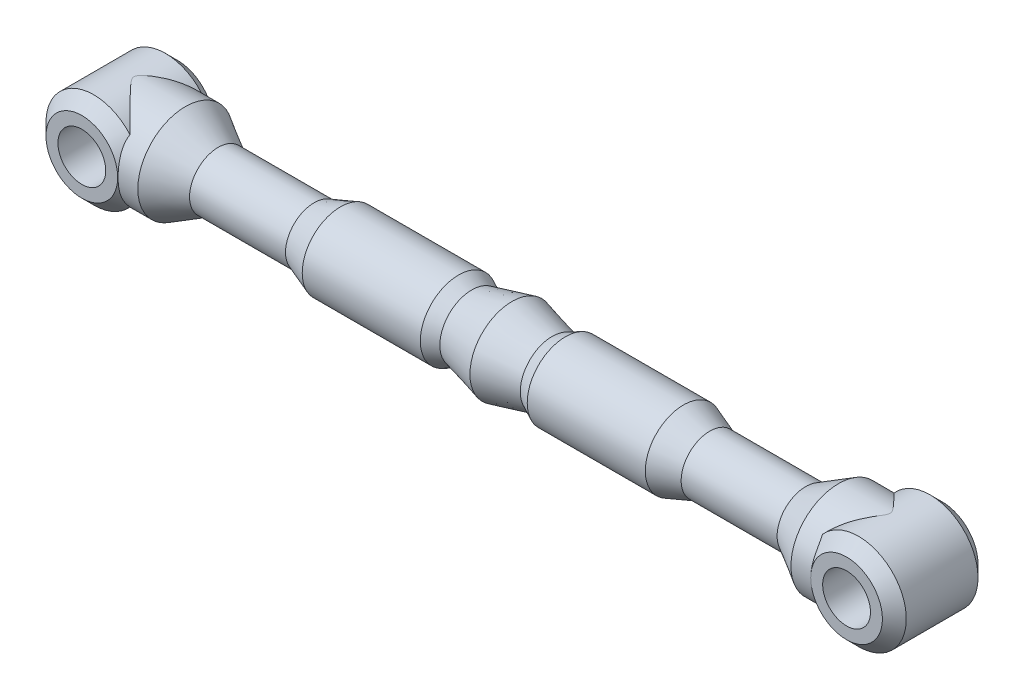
ISO-10303-21;
HEADER;
FILE_DESCRIPTION(('STEP AP214'),'2;1');
FILE_NAME('part.step','',(''),(''),'','','');
FILE_SCHEMA(('AUTOMOTIVE_DESIGN { 1 0 10303 214 1 1 1 1 }'));
ENDSEC;
DATA;
#1=APPLICATION_CONTEXT('core data for automotive mechanical design processes');
#2=APPLICATION_PROTOCOL_DEFINITION('international standard','automotive_design',2000,#1);
#3=PRODUCT_CONTEXT('',#1,'mechanical');
#4=PRODUCT('Part','Part','',(#3));
#5=PRODUCT_RELATED_PRODUCT_CATEGORY('part','',(#4));
#6=PRODUCT_DEFINITION_FORMATION('','',#4);
#7=PRODUCT_DEFINITION_CONTEXT('part definition',#1,'design');
#8=PRODUCT_DEFINITION('design','',#6,#7);
#9=PRODUCT_DEFINITION_SHAPE('','',#8);
#10=(LENGTH_UNIT() NAMED_UNIT(*) SI_UNIT(.MILLI.,.METRE.));
#11=(NAMED_UNIT(*) PLANE_ANGLE_UNIT() SI_UNIT($,.RADIAN.));
#12=(NAMED_UNIT(*) SI_UNIT($,.STERADIAN.) SOLID_ANGLE_UNIT());
#13=UNCERTAINTY_MEASURE_WITH_UNIT(LENGTH_MEASURE(1.E-05),#10,'distance_accuracy_value','');
#14=(GEOMETRIC_REPRESENTATION_CONTEXT(3) GLOBAL_UNCERTAINTY_ASSIGNED_CONTEXT((#13)) GLOBAL_UNIT_ASSIGNED_CONTEXT((#10,
#11,#12)) REPRESENTATION_CONTEXT('',''));
#15=CARTESIAN_POINT('',(0.,0.,0.));
#16=DIRECTION('',(0.,0.,1.));
#17=DIRECTION('',(1.,0.,0.));
#18=AXIS2_PLACEMENT_3D('',#15,#16,#17);
#19=CARTESIAN_POINT('',(-50.8,0.,6.35));
#20=DIRECTION('',(0.,0.,-1.));
#21=DIRECTION('',(-1.,0.,0.));
#22=AXIS2_PLACEMENT_3D('',#19,#20,#21);
#23=PLANE('',#22);
#24=CARTESIAN_POINT('',(-50.8,0.,6.35));
#25=DIRECTION('',(0.,0.,-1.));
#26=DIRECTION('',(-1.,0.,0.));
#27=AXIS2_PLACEMENT_3D('',#24,#25,#26);
#28=CIRCLE('',#27,4.76249999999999);
#29=CARTESIAN_POINT('',(-55.5625,0.,6.35));
#30=VERTEX_POINT('',#29);
#31=EDGE_CURVE('E350',#30,#30,#28,.F.);
#32=ORIENTED_EDGE('',*,*,#31,.T.);
#33=EDGE_LOOP('',(#32));
#34=FACE_BOUND('',#33,.T.);
#35=CARTESIAN_POINT('',(-50.8,0.,6.35));
#36=DIRECTION('',(0.,0.,-1.));
#37=DIRECTION('',(-1.,0.,0.));
#38=AXIS2_PLACEMENT_3D('',#35,#36,#37);
#39=CIRCLE('',#38,3.175);
#40=CARTESIAN_POINT('',(-53.975,0.,6.35));
#41=VERTEX_POINT('',#40);
#42=EDGE_CURVE('E360',#41,#41,#39,.T.);
#43=ORIENTED_EDGE('',*,*,#42,.T.);
#44=EDGE_LOOP('',(#43));
#45=FACE_BOUND('',#44,.T.);
#46=ADVANCED_FACE('F28',(#34,#45),#23,.F.);
#47=CARTESIAN_POINT('',(-50.8,0.,-6.35));
#48=DIRECTION('',(0.,0.,-1.));
#49=DIRECTION('',(-1.,0.,0.));
#50=AXIS2_PLACEMENT_3D('',#47,#48,#49);
#51=PLANE('',#50);
#52=CARTESIAN_POINT('',(-50.8,0.,-6.35));
#53=DIRECTION('',(0.,0.,-1.));
#54=DIRECTION('',(-1.,0.,0.));
#55=AXIS2_PLACEMENT_3D('',#52,#53,#54);
#56=CIRCLE('',#55,4.76249999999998);
#57=CARTESIAN_POINT('',(-55.5625,0.,-6.35));
#58=VERTEX_POINT('',#57);
#59=EDGE_CURVE('E353',#58,#58,#56,.T.);
#60=ORIENTED_EDGE('',*,*,#59,.T.);
#61=EDGE_LOOP('',(#60));
#62=FACE_BOUND('',#61,.T.);
#63=CARTESIAN_POINT('',(-50.8,0.,-6.35));
#64=DIRECTION('',(0.,0.,-1.));
#65=DIRECTION('',(-1.,0.,0.));
#66=AXIS2_PLACEMENT_3D('',#63,#64,#65);
#67=CIRCLE('',#66,3.175);
#68=CARTESIAN_POINT('',(-53.975,0.,-6.35));
#69=VERTEX_POINT('',#68);
#70=EDGE_CURVE('E182',#69,#69,#67,.T.);
#71=ORIENTED_EDGE('',*,*,#70,.F.);
#72=EDGE_LOOP('',(#71));
#73=FACE_BOUND('',#72,.T.);
#74=ADVANCED_FACE('F153',(#62,#73),#51,.T.);
#75=CARTESIAN_POINT('',(-59.949655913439,0.,0.));
#76=DIRECTION('',(-1.,0.,0.));
#77=DIRECTION('',(0.,0.,1.));
#78=AXIS2_PLACEMENT_3D('',#75,#76,#77);
#79=CYLINDRICAL_SURFACE('',#78,6.3246);
#80=CARTESIAN_POINT('',(43.3861252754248,0.,0.));
#81=DIRECTION('',(-1.,0.,0.));
#82=DIRECTION('',(0.,0.,1.));
#83=AXIS2_PLACEMENT_3D('',#80,#81,#82);
#84=CIRCLE('',#83,6.3246);
#85=CARTESIAN_POINT('',(43.3861252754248,0.,6.3246));
#86=VERTEX_POINT('',#85);
#87=EDGE_CURVE('E97',#86,#86,#84,.T.);
#88=ORIENTED_EDGE('',*,*,#87,.F.);
#89=EDGE_LOOP('',(#88));
#90=FACE_BOUND('',#89,.T.);
#91=CARTESIAN_POINT('',(44.45,0.,6.3246));
#92=CARTESIAN_POINT('',(44.450001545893,-0.141088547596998,6.32459845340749));
#93=CARTESIAN_POINT('',(44.4547133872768,-0.282226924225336,6.31986772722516));
#94=CARTESIAN_POINT('',(44.4734655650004,-0.563321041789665,6.30103989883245));
#95=CARTESIAN_POINT('',(44.4875124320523,-0.703275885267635,6.28693623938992));
#96=CARTESIAN_POINT('',(44.5246752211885,-0.981057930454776,6.24962151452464));
#97=CARTESIAN_POINT('',(44.5478107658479,-1.11887985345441,6.2263907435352));
#98=CARTESIAN_POINT('',(44.6026896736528,-1.39109239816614,6.17128242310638));
#99=CARTESIAN_POINT('',(44.6344372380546,-1.52548131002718,6.13940065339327));
#100=CARTESIAN_POINT('',(44.7056582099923,-1.78884238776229,6.06787259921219));
#101=CARTESIAN_POINT('',(44.7450682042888,-1.91784911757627,6.028290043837));
#102=CARTESIAN_POINT('',(44.8311291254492,-2.17093668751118,5.94184325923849));
#103=CARTESIAN_POINT('',(44.8777827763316,-2.29501565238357,5.89497629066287));
#104=CARTESIAN_POINT('',(45.0275192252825,-2.6588857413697,5.74453595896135));
#105=CARTESIAN_POINT('',(45.1404570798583,-2.89059599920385,5.63104328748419));
#106=CARTESIAN_POINT('',(45.4379389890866,-3.4201056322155,5.33198752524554));
#107=CARTESIAN_POINT('',(45.6328700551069,-3.70612982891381,5.13594036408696));
#108=CARTESIAN_POINT('',(45.9472261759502,-4.09895078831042,4.81950443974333));
#109=CARTESIAN_POINT('',(46.0558657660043,-4.22402867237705,4.71010240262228));
#110=CARTESIAN_POINT('',(46.2793613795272,-4.46239659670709,4.48491128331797));
#111=CARTESIAN_POINT('',(46.394217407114,-4.57568662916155,4.36912219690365));
#112=CARTESIAN_POINT('',(46.6743998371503,-4.83225170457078,4.08645529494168));
#113=CARTESIAN_POINT('',(46.8420944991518,-4.97022087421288,3.91710955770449));
#114=CARTESIAN_POINT('',(47.1850429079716,-5.22496191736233,3.57024701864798));
#115=CARTESIAN_POINT('',(47.3603002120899,-5.34172367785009,3.39272636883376));
#116=CARTESIAN_POINT('',(47.7162472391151,-5.55481553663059,3.0312672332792));
#117=CARTESIAN_POINT('',(47.8969341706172,-5.65115593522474,2.84733203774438));
#118=CARTESIAN_POINT('',(48.2619510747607,-5.82422075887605,2.4741330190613));
#119=CARTESIAN_POINT('',(48.4462793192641,-5.90095425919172,2.28487170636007));
#120=CARTESIAN_POINT('',(48.7504464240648,-6.01148020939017,1.96970719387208));
#121=CARTESIAN_POINT('',(48.8698384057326,-6.05082703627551,1.84528186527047));
#122=CARTESIAN_POINT('',(49.1082491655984,-6.12175488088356,1.59426898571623));
#123=CARTESIAN_POINT('',(49.2272682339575,-6.15334879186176,1.46768540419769));
#124=CARTESIAN_POINT('',(49.4279853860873,-6.2005889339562,1.24967435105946));
#125=CARTESIAN_POINT('',(49.5101632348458,-6.21817559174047,1.159098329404));
#126=CARTESIAN_POINT('',(49.6726382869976,-6.2496691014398,0.975171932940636));
#127=CARTESIAN_POINT('',(49.7529305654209,-6.2635671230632,0.881815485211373));
#128=CARTESIAN_POINT('',(49.8904295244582,-6.28481379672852,0.712198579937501));
#129=CARTESIAN_POINT('',(49.9487227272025,-6.29293327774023,0.636899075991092));
#130=CARTESIAN_POINT('',(50.0583546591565,-6.30677300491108,0.480983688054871));
#131=CARTESIAN_POINT('',(50.1097168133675,-6.31250147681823,0.400387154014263));
#132=CARTESIAN_POINT('',(50.1687095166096,-6.31856891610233,0.278465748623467));
#133=CARTESIAN_POINT('',(50.1844725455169,-6.32011039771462,0.241316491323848));
#134=CARTESIAN_POINT('',(50.2101635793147,-6.32255933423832,0.165085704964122));
#135=CARTESIAN_POINT('',(50.2201167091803,-6.32346952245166,0.126013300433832));
#136=CARTESIAN_POINT('',(50.2310613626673,-6.32446341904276,0.0531433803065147));
#137=CARTESIAN_POINT('',(50.2332591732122,-6.32465858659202,0.0195373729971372));
#138=CARTESIAN_POINT('',(50.2316098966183,-6.32451046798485,-0.0475171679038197));
#139=CARTESIAN_POINT('',(50.2277623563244,-6.3241671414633,-0.0809656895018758));
#140=CARTESIAN_POINT('',(50.2125483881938,-6.32277412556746,-0.158352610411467));
#141=CARTESIAN_POINT('',(50.1990128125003,-6.32151841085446,-0.201841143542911));
#142=CARTESIAN_POINT('',(50.165629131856,-6.31825573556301,-0.28639070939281));
#143=CARTESIAN_POINT('',(50.1457444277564,-6.31624440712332,-0.327435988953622));
#144=CARTESIAN_POINT('',(50.0850466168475,-6.30974235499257,-0.439214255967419));
#145=CARTESIAN_POINT('',(50.0401588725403,-6.30455144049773,-0.507621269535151));
#146=CARTESIAN_POINT('',(49.9453662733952,-6.29241133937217,-0.640764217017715));
#147=CARTESIAN_POINT('',(49.895445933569,-6.2854566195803,-0.705487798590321));
#148=CARTESIAN_POINT('',(49.7927783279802,-6.26982567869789,-0.833065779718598));
#149=CARTESIAN_POINT('',(49.7400163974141,-6.2611397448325,-0.895907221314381));
#150=CARTESIAN_POINT('',(49.6331983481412,-6.24211692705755,-1.02003465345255));
#151=CARTESIAN_POINT('',(49.5791443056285,-6.23178255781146,-1.08132285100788));
#152=CARTESIAN_POINT('',(49.4189956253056,-6.19894696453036,-1.26018060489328));
#153=CARTESIAN_POINT('',(49.3118397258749,-6.17415423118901,-1.37638776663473));
#154=CARTESIAN_POINT('',(49.0966960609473,-6.11830509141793,-1.60651424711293));
#155=CARTESIAN_POINT('',(48.9887081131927,-6.08724727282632,-1.72043304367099));
#156=CARTESIAN_POINT('',(48.6646056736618,-5.98447536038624,-2.05976103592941));
#157=CARTESIAN_POINT('',(48.4485971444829,-5.9032115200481,-2.28247801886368));
#158=CARTESIAN_POINT('',(48.0217455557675,-5.71473217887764,-2.72008594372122));
#159=CARTESIAN_POINT('',(47.8108868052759,-5.60761038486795,-2.93500199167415));
#160=CARTESIAN_POINT('',(47.396433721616,-5.36616058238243,-3.35615143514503));
#161=CARTESIAN_POINT('',(47.1928330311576,-5.23185710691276,-3.5623924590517));
#162=CARTESIAN_POINT('',(46.8673796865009,-4.98820122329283,-3.89151849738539));
#163=CARTESIAN_POINT('',(46.7424934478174,-4.88728218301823,-4.01767373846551));
#164=CARTESIAN_POINT('',(46.4978665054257,-4.67338820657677,-4.26458696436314));
#165=CARTESIAN_POINT('',(46.3781257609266,-4.56041336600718,-4.38534499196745));
#166=CARTESIAN_POINT('',(46.0283923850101,-4.20300825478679,-4.73784465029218));
#167=CARTESIAN_POINT('',(45.8074534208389,-3.93977946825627,-4.96025143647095));
#168=CARTESIAN_POINT('',(45.4436609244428,-3.42201647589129,-5.32623100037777));
#169=CARTESIAN_POINT('',(45.294123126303,-3.17705337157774,-5.47658023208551));
#170=CARTESIAN_POINT('',(45.0921979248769,-2.78657273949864,-5.67953481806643));
#171=CARTESIAN_POINT('',(45.0286270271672,-2.65259334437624,-5.74341751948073));
#172=CARTESIAN_POINT('',(44.9098927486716,-2.37730516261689,-5.86271799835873));
#173=CARTESIAN_POINT('',(44.8547278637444,-2.23599769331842,-5.91813729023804));
#174=CARTESIAN_POINT('',(44.7624826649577,-1.97154805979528,-6.0107983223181));
#175=CARTESIAN_POINT('',(44.72392319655,-1.84944033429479,-6.0495276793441));
#176=CARTESIAN_POINT('',(44.6538495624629,-1.60123514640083,-6.11990531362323));
#177=CARTESIAN_POINT('',(44.6223340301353,-1.47513846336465,-6.15155496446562));
#178=CARTESIAN_POINT('',(44.5668689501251,-1.21969313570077,-6.20725336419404));
#179=CARTESIAN_POINT('',(44.5429162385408,-1.09034587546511,-6.23130529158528));
#180=CARTESIAN_POINT('',(44.5029856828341,-0.829190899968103,-6.27139998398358));
#181=CARTESIAN_POINT('',(44.487007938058,-0.697383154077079,-6.28744264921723));
#182=CARTESIAN_POINT('',(44.4632905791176,-0.431799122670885,-6.31125602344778));
#183=CARTESIAN_POINT('',(44.4555808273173,-0.298017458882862,-6.31899674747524));
#184=CARTESIAN_POINT('',(44.4486562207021,-0.0300116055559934,-6.32594918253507));
#185=CARTESIAN_POINT('',(44.4494413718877,0.104212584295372,-6.32516088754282));
#186=CARTESIAN_POINT('',(44.4594910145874,0.372025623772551,-6.31507082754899));
#187=CARTESIAN_POINT('',(44.4687558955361,0.505614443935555,-6.30576867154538));
#188=CARTESIAN_POINT('',(44.4955803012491,0.77110018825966,-6.27883542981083));
#189=CARTESIAN_POINT('',(44.513139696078,0.902997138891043,-6.26120447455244));
#190=CARTESIAN_POINT('',(44.5550496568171,1.15704509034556,-6.21912159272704));
#191=CARTESIAN_POINT('',(44.5789791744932,1.27933612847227,-6.19509254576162));
#192=CARTESIAN_POINT('',(44.6335746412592,1.52087405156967,-6.14026653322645));
#193=CARTESIAN_POINT('',(44.6642431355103,1.6401197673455,-6.10946701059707));
#194=CARTESIAN_POINT('',(44.765717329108,1.99236119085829,-6.00755133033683));
#195=CARTESIAN_POINT('',(44.8460163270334,2.22000593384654,-5.92689337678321));
#196=CARTESIAN_POINT('',(44.9993056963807,2.58862547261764,-5.77288110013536));
#197=CARTESIAN_POINT('',(45.0667119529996,2.73441946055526,-5.70514764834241));
#198=CARTESIAN_POINT('',(45.2102920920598,3.01708143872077,-5.5608409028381));
#199=CARTESIAN_POINT('',(45.2864685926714,3.15394674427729,-5.48426496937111));
#200=CARTESIAN_POINT('',(45.5265984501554,3.55097873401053,-5.24281562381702));
#201=CARTESIAN_POINT('',(45.7020436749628,3.79732888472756,-5.06632962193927));
#202=CARTESIAN_POINT('',(46.0163474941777,4.18090679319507,-4.74990699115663));
#203=CARTESIAN_POINT('',(46.1494016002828,4.32811325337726,-4.6158891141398));
#204=CARTESIAN_POINT('',(46.423949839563,4.60550951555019,-4.33914549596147));
#205=CARTESIAN_POINT('',(46.5654434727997,4.73570032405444,-4.19642027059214));
#206=CARTESIAN_POINT('',(46.8553392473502,4.97977212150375,-3.90369429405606));
#207=CARTESIAN_POINT('',(47.0037520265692,5.09362681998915,-3.75368232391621));
#208=CARTESIAN_POINT('',(47.3058232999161,5.30539756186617,-3.44788365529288));
#209=CARTESIAN_POINT('',(47.4594812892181,5.40331513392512,-3.29209751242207));
#210=CARTESIAN_POINT('',(47.7789219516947,5.58850792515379,-2.96746940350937));
#211=CARTESIAN_POINT('',(47.9449188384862,5.67496079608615,-2.79837041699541));
#212=CARTESIAN_POINT('',(48.2799221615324,5.83145766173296,-2.45563709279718));
#213=CARTESIAN_POINT('',(48.4489288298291,5.90150038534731,-2.28200240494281));
#214=CARTESIAN_POINT('',(48.7879992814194,6.0255111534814,-1.93091300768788));
#215=CARTESIAN_POINT('',(48.9580596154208,6.07951685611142,-1.75346831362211));
#216=CARTESIAN_POINT('',(49.2121106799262,6.14888940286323,-1.48335538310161));
#217=CARTESIAN_POINT('',(49.2966358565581,6.17007694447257,-1.39264384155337));
#218=CARTESIAN_POINT('',(49.4646100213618,6.20859322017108,-1.20942948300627));
#219=CARTESIAN_POINT('',(49.5480592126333,6.22592269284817,-1.11692701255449));
#220=CARTESIAN_POINT('',(49.6929248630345,6.25307674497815,-0.95124745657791));
#221=CARTESIAN_POINT('',(49.754883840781,6.26370692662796,-0.878674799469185));
#222=CARTESIAN_POINT('',(49.8757905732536,6.28267728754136,-0.730829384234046));
#223=CARTESIAN_POINT('',(49.9347419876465,6.29102030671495,-0.655560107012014));
#224=CARTESIAN_POINT('',(50.0238425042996,6.30247897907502,-0.530612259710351));
#225=CARTESIAN_POINT('',(50.0561682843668,6.30635754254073,-0.482573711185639));
#226=CARTESIAN_POINT('',(50.1162806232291,6.31315504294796,-0.383545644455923));
#227=CARTESIAN_POINT('',(50.1440695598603,6.31607448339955,-0.332557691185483));
#228=CARTESIAN_POINT('',(50.1825985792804,6.3199330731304,-0.245312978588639));
#229=CARTESIAN_POINT('',(50.1958908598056,6.3212073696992,-0.210236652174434));
#230=CARTESIAN_POINT('',(50.2169455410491,6.3231843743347,-0.138501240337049));
#231=CARTESIAN_POINT('',(50.2247295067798,6.32388931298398,-0.101848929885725));
#232=CARTESIAN_POINT('',(50.2331714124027,6.32465249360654,-0.0271891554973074));
#233=CARTESIAN_POINT('',(50.2337378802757,6.32470243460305,0.0108295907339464));
#234=CARTESIAN_POINT('',(50.2273328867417,6.32412518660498,0.0862295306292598));
#235=CARTESIAN_POINT('',(50.2203487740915,6.32349686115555,0.12360954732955));
#236=CARTESIAN_POINT('',(50.1968549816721,6.32130444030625,0.21023346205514));
#237=CARTESIAN_POINT('',(50.1777719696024,6.31947958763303,0.258731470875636));
#238=CARTESIAN_POINT('',(50.1331832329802,6.31493229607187,0.352739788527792));
#239=CARTESIAN_POINT('',(50.1076400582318,6.31220459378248,0.398230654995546));
#240=CARTESIAN_POINT('',(50.0212145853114,6.30233770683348,0.538983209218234));
#241=CARTESIAN_POINT('',(49.9539858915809,6.29377381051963,0.630124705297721));
#242=CARTESIAN_POINT('',(49.8141737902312,6.27342007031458,0.807894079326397));
#243=CARTESIAN_POINT('',(49.741573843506,6.26161993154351,0.89450648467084));
#244=CARTESIAN_POINT('',(49.5936171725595,6.23480516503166,1.06549875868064));
#245=CARTESIAN_POINT('',(49.5182505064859,6.21977775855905,1.14986820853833));
#246=CARTESIAN_POINT('',(49.366538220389,6.18657656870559,1.31683667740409));
#247=CARTESIAN_POINT('',(49.2901941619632,6.16840733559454,1.3994380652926));
#248=CARTESIAN_POINT('',(49.1087038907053,6.12158031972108,1.59379458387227));
#249=CARTESIAN_POINT('',(49.0033526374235,6.09152916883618,1.70502817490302));
#250=CARTESIAN_POINT('',(48.7926853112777,6.02539588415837,1.92572765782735));
#251=CARTESIAN_POINT('',(48.6873692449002,5.98931295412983,2.03519331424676));
#252=CARTESIAN_POINT('',(48.3720685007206,5.87179489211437,2.3613754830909));
#253=CARTESIAN_POINT('',(48.1629203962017,5.78113837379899,2.57567787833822));
#254=CARTESIAN_POINT('',(47.7505548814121,5.57462829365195,2.99646934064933));
#255=CARTESIAN_POINT('',(47.5473228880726,5.45884393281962,3.20297807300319));
#256=CARTESIAN_POINT('',(47.1489290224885,5.20081189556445,3.6068676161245));
#257=CARTESIAN_POINT('',(46.9537606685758,5.05858599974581,3.80425577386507));
#258=CARTESIAN_POINT('',(46.6437791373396,4.80339640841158,4.1173436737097));
#259=CARTESIAN_POINT('',(46.5256540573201,4.69871977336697,4.2365461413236));
#260=CARTESIAN_POINT('',(46.2948103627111,4.47786755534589,4.46934299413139));
#261=CARTESIAN_POINT('',(46.1820915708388,4.36169234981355,4.58293756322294));
#262=CARTESIAN_POINT('',(45.8538548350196,3.99567398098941,4.9135649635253));
#263=CARTESIAN_POINT('',(45.6477714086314,3.72794810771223,5.12093101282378));
#264=CARTESIAN_POINT('',(45.3116930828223,3.2056209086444,5.45892141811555));
#265=CARTESIAN_POINT('',(45.1748050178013,2.96004292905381,5.59651950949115));
#266=CARTESIAN_POINT('',(44.991840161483,2.57067823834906,5.7803825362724));
#267=CARTESIAN_POINT('',(44.9345728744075,2.43736892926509,5.83792143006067));
#268=CARTESIAN_POINT('',(44.8283847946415,2.1641991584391,5.94460087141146));
#269=CARTESIAN_POINT('',(44.7794623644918,2.02433998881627,5.99374306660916));
#270=CARTESIAN_POINT('',(44.6977631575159,1.76100988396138,6.0758021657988));
#271=CARTESIAN_POINT('',(44.6636589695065,1.63836435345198,6.11005354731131));
#272=CARTESIAN_POINT('',(44.6025801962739,1.3895629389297,6.17139249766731));
#273=CARTESIAN_POINT('',(44.5756042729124,1.26340771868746,6.19848141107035));
#274=CARTESIAN_POINT('',(44.5292810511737,1.00861986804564,6.24499685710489));
#275=CARTESIAN_POINT('',(44.5099164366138,0.879993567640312,6.26444078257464));
#276=CARTESIAN_POINT('',(44.4790840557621,0.620903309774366,6.29539875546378));
#277=CARTESIAN_POINT('',(44.467611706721,0.490440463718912,6.3069174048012));
#278=CARTESIAN_POINT('',(44.4567956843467,0.299754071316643,6.31777699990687));
#279=CARTESIAN_POINT('',(44.4542487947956,0.239866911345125,6.32033413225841));
#280=CARTESIAN_POINT('',(44.4508505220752,0.119989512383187,6.32374606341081));
#281=CARTESIAN_POINT('',(44.4499993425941,0.0599992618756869,6.32460065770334));
#282=CARTESIAN_POINT('',(44.45,0.,6.3246));
#283=B_SPLINE_CURVE_WITH_KNOTS('',3,(#91,#92,#93,#94,#95,#96,#97,#98,#99,#100,#101,#102,#103,
#104,#105,#106,#107,#108,#109,#110,#111,#112,#113,#114,#115,#116,#117,#118,#119,#120,#121,#122,
#123,#124,#125,#126,#127,#128,#129,#130,#131,#132,#133,#134,#135,#136,#137,#138,#139,#140,#141,
#142,#143,#144,#145,#146,#147,#148,#149,#150,#151,#152,#153,#154,#155,#156,#157,#158,#159,#160,
#161,#162,#163,#164,#165,#166,#167,#168,#169,#170,#171,#172,#173,#174,#175,#176,#177,#178,#179,
#180,#181,#182,#183,#184,#185,#186,#187,#188,#189,#190,#191,#192,#193,#194,#195,#196,#197,#198,
#199,#200,#201,#202,#203,#204,#205,#206,#207,#208,#209,#210,#211,#212,#213,#214,#215,#216,#217,
#218,#219,#220,#221,#222,#223,#224,#225,#226,#227,#228,#229,#230,#231,#232,#233,#234,#235,#236,
#237,#238,#239,#240,#241,#242,#243,#244,#245,#246,#247,#248,#249,#250,#251,#252,#253,#254,#255,
#256,#257,#258,#259,#260,#261,#262,#263,#264,#265,#266,#267,#268,#269,#270,#271,#272,#273,#274,
#275,#276,#277,#278,#279,#280,#281,#282),.UNSPECIFIED.,.T.,.F.,(4,2,2,2,2,2,2,2,2,2,2,2,2,2,2,2,
2,2,2,2,2,2,2,2,2,2,2,2,2,2,2,2,2,2,2,2,2,2,2,2,2,2,2,2,2,2,2,2,2,2,2,2,2,2,2,2,2,2,2,2,2,2,2,2,
2,2,2,2,2,2,2,2,2,2,2,2,2,2,2,2,2,2,2,2,2,2,2,2,2,2,2,2,2,2,2,4),(0.,0.423195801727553,
0.846687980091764,1.2710995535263,1.69571854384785,2.11696252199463,2.53836529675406,
3.38025922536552,4.56679379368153,5.16199663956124,5.75719987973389,6.58215494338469,
7.40750237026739,8.23243250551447,9.05698011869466,9.58744534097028,10.1170223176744,
10.4876514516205,10.8591599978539,11.1458801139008,11.4316055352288,11.5524544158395,
11.6727767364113,11.7732756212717,11.8737820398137,12.009650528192,12.1463168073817,
12.3915791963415,12.6376207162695,12.8850835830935,13.1321724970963,13.6119961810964,
14.0919281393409,15.0528778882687,16.0103961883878,16.9670540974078,17.5791815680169,
18.1913041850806,19.4134815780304,20.381552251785,20.8654536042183,21.3492682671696,
21.7502107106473,22.1510752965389,22.5517719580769,22.95247361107,23.3546176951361,
23.7567620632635,24.1589249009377,24.5610814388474,24.9413771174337,25.3218166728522,
26.0822538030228,26.6045873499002,27.127077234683,28.1729330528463,28.8904684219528,
29.6079613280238,30.3265962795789,31.0451622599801,31.80123764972,32.5573715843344,
33.3117156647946,33.6890200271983,34.0662520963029,34.3542531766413,34.6418950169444,
34.8158804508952,34.9897744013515,35.1020637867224,35.2139110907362,35.3271745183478,
35.4406280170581,35.5961896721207,35.7526746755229,36.0924666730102,36.433352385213,
36.7756136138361,37.1173832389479,37.5856107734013,38.0539001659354,38.9913132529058,
39.9261767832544,40.8602736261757,41.4531782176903,42.0460633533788,43.2294797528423,
44.1647031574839,44.632454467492,45.1001138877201,45.4951914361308,45.8901947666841,
46.2842941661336,46.6781645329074,46.8581110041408,47.0380790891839),.UNSPECIFIED.);
#284=CARTESIAN_POINT('',(46.0038201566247,-4.16162935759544,4.76249999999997));
#285=VERTEX_POINT('',#284);
#286=CARTESIAN_POINT('',(46.0038201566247,-4.16162935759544,-4.76249999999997));
#287=VERTEX_POINT('',#286);
#288=EDGE_CURVE('E87',#285,#287,#283,.T.);
#289=ORIENTED_EDGE('',*,*,#288,.F.);
#290=CARTESIAN_POINT('',(46.0038201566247,-4.16162935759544,4.76249999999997));
#291=CARTESIAN_POINT('',(46.0209111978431,-4.10258082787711,4.81410316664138));
#292=CARTESIAN_POINT('',(46.0361238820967,-4.04227740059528,4.86485591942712));
#293=CARTESIAN_POINT('',(46.063012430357,-3.91936274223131,4.96441398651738));
#294=CARTESIAN_POINT('',(46.0746898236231,-3.8567525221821,5.01322013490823));
#295=CARTESIAN_POINT('',(46.1046943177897,-3.66615550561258,5.15606324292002));
#296=CARTESIAN_POINT('',(46.118116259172,-3.53496454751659,5.24690840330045));
#297=CARTESIAN_POINT('',(46.1345003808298,-3.2665182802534,5.41808538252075));
#298=CARTESIAN_POINT('',(46.1375256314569,-3.12930467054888,5.49847773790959));
#299=CARTESIAN_POINT('',(46.1364107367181,-2.84913518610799,5.64874243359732));
#300=CARTESIAN_POINT('',(46.1322636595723,-2.70617388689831,5.71860452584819));
#301=CARTESIAN_POINT('',(46.119065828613,-2.39881843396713,5.8547117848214));
#302=CARTESIAN_POINT('',(46.1095051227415,-2.23385270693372,5.91961271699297));
#303=CARTESIAN_POINT('',(46.0887711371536,-1.89919043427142,6.03531158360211));
#304=CARTESIAN_POINT('',(46.0775980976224,-1.72949459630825,6.08611161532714));
#305=CARTESIAN_POINT('',(46.056459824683,-1.38627898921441,6.17334251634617));
#306=CARTESIAN_POINT('',(46.0464951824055,-1.21275739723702,6.20976637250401));
#307=CARTESIAN_POINT('',(46.029818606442,-0.863113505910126,6.26793456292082));
#308=CARTESIAN_POINT('',(46.023106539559,-0.686991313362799,6.28967949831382));
#309=CARTESIAN_POINT('',(46.0141651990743,-0.333767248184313,6.31826691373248));
#310=CARTESIAN_POINT('',(46.0119272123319,-0.15666795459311,6.32513836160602));
#311=CARTESIAN_POINT('',(46.012293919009,0.197480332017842,6.32399579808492));
#312=CARTESIAN_POINT('',(46.0148986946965,0.374529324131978,6.31598153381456));
#313=CARTESIAN_POINT('',(46.0245110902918,0.727583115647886,6.28511401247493));
#314=CARTESIAN_POINT('',(46.0315281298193,0.903584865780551,6.26222900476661));
#315=CARTESIAN_POINT('',(46.0486878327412,1.25288379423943,6.20179536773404));
#316=CARTESIAN_POINT('',(46.0588304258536,1.42618103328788,6.16424706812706));
#317=CARTESIAN_POINT('',(46.0798604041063,1.76447513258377,6.07593246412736));
#318=CARTESIAN_POINT('',(46.0907214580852,1.92957059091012,6.02553652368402));
#319=CARTESIAN_POINT('',(46.1107504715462,2.25523838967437,5.91136568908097));
#320=CARTESIAN_POINT('',(46.1199179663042,2.41580947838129,5.84758713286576));
#321=CARTESIAN_POINT('',(46.1331805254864,2.73059629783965,5.7073585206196));
#322=CARTESIAN_POINT('',(46.1373010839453,2.88484013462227,5.63097438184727));
#323=CARTESIAN_POINT('',(46.1367384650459,3.18648679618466,5.46592833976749));
#324=CARTESIAN_POINT('',(46.1320638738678,3.33389614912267,5.37727848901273));
#325=CARTESIAN_POINT('',(46.1117772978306,3.5976778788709,5.20366124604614));
#326=CARTESIAN_POINT('',(46.0980177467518,3.71526456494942,5.12034006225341));
#327=CARTESIAN_POINT('',(46.0691702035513,3.88655438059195,4.99003469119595));
#328=CARTESIAN_POINT('',(46.0581535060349,3.94291908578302,4.94561031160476));
#329=CARTESIAN_POINT('',(46.0332099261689,4.05374234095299,4.8551889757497));
#330=CARTESIAN_POINT('',(46.0192820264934,4.10820021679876,4.80919147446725));
#331=CARTESIAN_POINT('',(46.0038201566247,4.16162935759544,4.76249999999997));
#332=B_SPLINE_CURVE_WITH_KNOTS('',3,(#290,#291,#292,#293,#294,#295,#296,#297,#298,#299,#300,
#301,#302,#303,#304,#305,#306,#307,#308,#309,#310,#311,#312,#313,#314,#315,#316,#317,#318,#319,
#320,#321,#322,#323,#324,#325,#326,#327,#328,#329,#330,#331),.UNSPECIFIED.,.F.,.F.,(4,2,2,2,2,2,
2,2,2,2,2,2,2,2,2,2,2,2,2,2,4),(0.,0.240703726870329,0.481303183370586,0.960728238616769,
1.43723973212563,1.91421201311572,2.44614171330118,2.97799225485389,3.51010192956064,
4.04218981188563,4.57324045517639,5.10430011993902,5.63649739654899,6.16868270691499,
6.68698514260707,7.20542959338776,7.72124423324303,8.2365555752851,8.6701311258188,
8.88786372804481,9.10567254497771),.UNSPECIFIED.);
#333=CARTESIAN_POINT('',(46.0038201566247,4.16162935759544,4.76249999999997));
#334=VERTEX_POINT('',#333);
#335=EDGE_CURVE('E72',#285,#334,#332,.T.);
#336=ORIENTED_EDGE('',*,*,#335,.T.);
#337=CARTESIAN_POINT('',(46.0038201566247,4.16162935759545,-4.76249999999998));
#338=VERTEX_POINT('',#337);
#339=EDGE_CURVE('E89',#338,#334,#283,.T.);
#340=ORIENTED_EDGE('',*,*,#339,.F.);
#341=CARTESIAN_POINT('',(46.0038201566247,4.16162935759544,-4.76249999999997));
#342=CARTESIAN_POINT('',(46.0209111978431,4.10258082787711,-4.81410316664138));
#343=CARTESIAN_POINT('',(46.0361238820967,4.04227740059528,-4.86485591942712));
#344=CARTESIAN_POINT('',(46.063012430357,3.91936274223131,-4.96441398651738));
#345=CARTESIAN_POINT('',(46.0746898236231,3.8567525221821,-5.01322013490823));
#346=CARTESIAN_POINT('',(46.1046943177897,3.66615550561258,-5.15606324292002));
#347=CARTESIAN_POINT('',(46.118116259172,3.53496454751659,-5.24690840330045));
#348=CARTESIAN_POINT('',(46.1345003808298,3.2665182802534,-5.41808538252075));
#349=CARTESIAN_POINT('',(46.1375256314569,3.12930467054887,-5.49847773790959));
#350=CARTESIAN_POINT('',(46.1364107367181,2.84913518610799,-5.64874243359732));
#351=CARTESIAN_POINT('',(46.1322636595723,2.70617388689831,-5.71860452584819));
#352=CARTESIAN_POINT('',(46.119065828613,2.39881843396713,-5.8547117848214));
#353=CARTESIAN_POINT('',(46.1095051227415,2.23385270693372,-5.91961271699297));
#354=CARTESIAN_POINT('',(46.0887711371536,1.89919043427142,-6.03531158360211));
#355=CARTESIAN_POINT('',(46.0775980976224,1.72949459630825,-6.08611161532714));
#356=CARTESIAN_POINT('',(46.056459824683,1.38627898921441,-6.17334251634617));
#357=CARTESIAN_POINT('',(46.0464951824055,1.21275739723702,-6.20976637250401));
#358=CARTESIAN_POINT('',(46.029818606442,0.863113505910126,-6.26793456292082));
#359=CARTESIAN_POINT('',(46.023106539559,0.686991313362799,-6.28967949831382));
#360=CARTESIAN_POINT('',(46.0141651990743,0.333767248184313,-6.31826691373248));
#361=CARTESIAN_POINT('',(46.0119272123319,0.156667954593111,-6.32513836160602));
#362=CARTESIAN_POINT('',(46.012293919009,-0.197480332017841,-6.32399579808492));
#363=CARTESIAN_POINT('',(46.0148986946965,-0.374529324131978,-6.31598153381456));
#364=CARTESIAN_POINT('',(46.0245110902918,-0.727583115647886,-6.28511401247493));
#365=CARTESIAN_POINT('',(46.0315281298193,-0.903584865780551,-6.26222900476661));
#366=CARTESIAN_POINT('',(46.0486878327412,-1.25288379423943,-6.20179536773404));
#367=CARTESIAN_POINT('',(46.0588304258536,-1.42618103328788,-6.16424706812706));
#368=CARTESIAN_POINT('',(46.0798604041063,-1.76447513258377,-6.07593246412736));
#369=CARTESIAN_POINT('',(46.0907214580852,-1.92957059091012,-6.02553652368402));
#370=CARTESIAN_POINT('',(46.1107504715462,-2.25523838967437,-5.91136568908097));
#371=CARTESIAN_POINT('',(46.1199179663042,-2.41580947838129,-5.84758713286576));
#372=CARTESIAN_POINT('',(46.1331805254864,-2.73059629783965,-5.7073585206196));
#373=CARTESIAN_POINT('',(46.1373010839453,-2.88484013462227,-5.63097438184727));
#374=CARTESIAN_POINT('',(46.1367384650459,-3.18648679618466,-5.46592833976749));
#375=CARTESIAN_POINT('',(46.1320638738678,-3.33389614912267,-5.37727848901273));
#376=CARTESIAN_POINT('',(46.1117772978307,-3.5976778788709,-5.20366124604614));
#377=CARTESIAN_POINT('',(46.0980177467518,-3.71526456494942,-5.12034006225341));
#378=CARTESIAN_POINT('',(46.0691702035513,-3.88655438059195,-4.99003469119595));
#379=CARTESIAN_POINT('',(46.0581535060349,-3.94291908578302,-4.94561031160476));
#380=CARTESIAN_POINT('',(46.0332099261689,-4.05374234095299,-4.8551889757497));
#381=CARTESIAN_POINT('',(46.0192820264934,-4.10820021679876,-4.80919147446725));
#382=CARTESIAN_POINT('',(46.0038201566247,-4.16162935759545,-4.76249999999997));
#383=B_SPLINE_CURVE_WITH_KNOTS('',3,(#341,#342,#343,#344,#345,#346,#347,#348,#349,#350,#351,
#352,#353,#354,#355,#356,#357,#358,#359,#360,#361,#362,#363,#364,#365,#366,#367,#368,#369,#370,
#371,#372,#373,#374,#375,#376,#377,#378,#379,#380,#381,#382),.UNSPECIFIED.,.F.,.F.,(4,2,2,2,2,2,
2,2,2,2,2,2,2,2,2,2,2,2,2,2,4),(0.,0.240703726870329,0.481303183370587,0.96072823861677,
1.43723973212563,1.91421201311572,2.44614171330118,2.97799225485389,3.51010192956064,
4.04218981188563,4.57324045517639,5.10430011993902,5.63649739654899,6.16868270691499,
6.68698514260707,7.20542959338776,7.72124423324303,8.2365555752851,8.6701311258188,
8.88786372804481,9.10567254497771),.UNSPECIFIED.);
#384=EDGE_CURVE('E11',#338,#287,#383,.T.);
#385=ORIENTED_EDGE('',*,*,#384,.T.);
#386=EDGE_LOOP('',(#289,#336,#340,#385));
#387=FACE_BOUND('',#386,.T.);
#388=ADVANCED_FACE('F30',(#90,#387),#79,.T.);
#389=CARTESIAN_POINT('',(43.3861252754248,0.,0.));
#390=DIRECTION('',(1.,0.,0.));
#391=DIRECTION('',(0.,0.,-1.));
#392=AXIS2_PLACEMENT_3D('',#389,#390,#391);
#393=CONICAL_SURFACE('',#392,6.3246,0.5235987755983);
#394=CARTESIAN_POINT('',(39.0307103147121,0.,0.));
#395=DIRECTION('',(-1.,0.,0.));
#396=DIRECTION('',(0.,0.,1.));
#397=AXIS2_PLACEMENT_3D('',#394,#395,#396);
#398=CIRCLE('',#397,3.81);
#399=CARTESIAN_POINT('',(39.0307103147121,0.,3.81));
#400=VERTEX_POINT('',#399);
#401=EDGE_CURVE('E214',#400,#400,#398,.T.);
#402=ORIENTED_EDGE('',*,*,#401,.F.);
#403=EDGE_LOOP('',(#402));
#404=FACE_BOUND('',#403,.T.);
#405=ORIENTED_EDGE('',*,*,#87,.T.);
#406=EDGE_LOOP('',(#405));
#407=FACE_BOUND('',#406,.T.);
#408=ADVANCED_FACE('F221',(#404,#407),#393,.T.);
#409=CARTESIAN_POINT('',(-59.949655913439,0.,0.));
#410=DIRECTION('',(-1.,0.,0.));
#411=DIRECTION('',(0.,0.,1.));
#412=AXIS2_PLACEMENT_3D('',#409,#410,#411);
#413=CYLINDRICAL_SURFACE('',#412,3.81);
#414=CARTESIAN_POINT('',(26.2797165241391,0.,0.));
#415=DIRECTION('',(-1.,0.,0.));
#416=DIRECTION('',(0.,0.,1.));
#417=AXIS2_PLACEMENT_3D('',#414,#415,#416);
#418=CIRCLE('',#417,3.81);
#419=CARTESIAN_POINT('',(26.2797165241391,0.,3.81));
#420=VERTEX_POINT('',#419);
#421=EDGE_CURVE('E212',#420,#420,#418,.T.);
#422=ORIENTED_EDGE('',*,*,#421,.F.);
#423=EDGE_LOOP('',(#422));
#424=FACE_BOUND('',#423,.T.);
#425=ORIENTED_EDGE('',*,*,#401,.T.);
#426=EDGE_LOOP('',(#425));
#427=FACE_BOUND('',#426,.T.);
#428=ADVANCED_FACE('F227',(#424,#427),#413,.T.);
#429=CARTESIAN_POINT('',(26.2797165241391,0.,0.));
#430=DIRECTION('',(-1.,0.,0.));
#431=DIRECTION('',(0.,0.,1.));
#432=AXIS2_PLACEMENT_3D('',#429,#430,#431);
#433=CONICAL_SURFACE('',#432,3.81,0.349065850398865);
#434=CARTESIAN_POINT('',(22.7904202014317,0.,0.));
#435=DIRECTION('',(-1.,0.,0.));
#436=DIRECTION('',(0.,0.,1.));
#437=AXIS2_PLACEMENT_3D('',#434,#435,#436);
#438=CIRCLE('',#437,5.08);
#439=CARTESIAN_POINT('',(22.7904202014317,0.,5.08));
#440=VERTEX_POINT('',#439);
#441=EDGE_CURVE('E209',#440,#440,#438,.T.);
#442=ORIENTED_EDGE('',*,*,#441,.F.);
#443=EDGE_LOOP('',(#442));
#444=FACE_BOUND('',#443,.T.);
#445=ORIENTED_EDGE('',*,*,#421,.T.);
#446=EDGE_LOOP('',(#445));
#447=FACE_BOUND('',#446,.T.);
#448=ADVANCED_FACE('F232',(#444,#447),#433,.T.);
#449=CARTESIAN_POINT('',(-59.949655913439,0.,0.));
#450=DIRECTION('',(-1.,0.,0.));
#451=DIRECTION('',(0.,0.,1.));
#452=AXIS2_PLACEMENT_3D('',#449,#450,#451);
#453=CYLINDRICAL_SURFACE('',#452,5.08);
#454=CARTESIAN_POINT('',(7.10180848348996,0.,0.));
#455=DIRECTION('',(-1.,0.,0.));
#456=DIRECTION('',(0.,0.,1.));
#457=AXIS2_PLACEMENT_3D('',#454,#455,#456);
#458=CIRCLE('',#457,5.08);
#459=CARTESIAN_POINT('',(7.10180848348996,0.,5.08));
#460=VERTEX_POINT('',#459);
#461=EDGE_CURVE('E206',#460,#460,#458,.T.);
#462=ORIENTED_EDGE('',*,*,#461,.F.);
#463=EDGE_LOOP('',(#462));
#464=FACE_BOUND('',#463,.T.);
#465=ORIENTED_EDGE('',*,*,#441,.T.);
#466=EDGE_LOOP('',(#465));
#467=FACE_BOUND('',#466,.T.);
#468=ADVANCED_FACE('F238',(#464,#467),#453,.T.);
#469=CARTESIAN_POINT('',(7.10180848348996,0.,0.));
#470=DIRECTION('',(1.,0.,0.));
#471=DIRECTION('',(0.,0.,-1.));
#472=AXIS2_PLACEMENT_3D('',#469,#470,#471);
#473=CONICAL_SURFACE('',#472,5.08,0.444419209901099);
#474=CARTESIAN_POINT('',(5.34370191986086,0.,0.));
#475=DIRECTION('',(-1.,0.,0.));
#476=DIRECTION('',(0.,0.,1.));
#477=AXIS2_PLACEMENT_3D('',#474,#475,#476);
#478=CIRCLE('',#477,4.24280639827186);
#479=CARTESIAN_POINT('',(5.34370191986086,0.,4.24280639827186));
#480=VERTEX_POINT('',#479);
#481=EDGE_CURVE('E203',#480,#480,#478,.T.);
#482=ORIENTED_EDGE('',*,*,#481,.F.);
#483=EDGE_LOOP('',(#482));
#484=FACE_BOUND('',#483,.T.);
#485=ORIENTED_EDGE('',*,*,#461,.T.);
#486=EDGE_LOOP('',(#485));
#487=FACE_BOUND('',#486,.T.);
#488=ADVANCED_FACE('F242',(#484,#487),#473,.T.);
#489=CARTESIAN_POINT('',(5.34370191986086,0.,0.));
#490=DIRECTION('',(-1.,0.,0.));
#491=DIRECTION('',(0.,0.,1.));
#492=AXIS2_PLACEMENT_3D('',#489,#490,#491);
#493=CONICAL_SURFACE('',#492,4.24280639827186,0.2466103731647);
#494=CARTESIAN_POINT('',(0.,0.,0.));
#495=DIRECTION('',(-1.,0.,0.));
#496=DIRECTION('',(0.,0.,1.));
#497=AXIS2_PLACEMENT_3D('',#494,#495,#496);
#498=CIRCLE('',#497,5.588);
#499=CARTESIAN_POINT('',(0.,0.,5.588));
#500=VERTEX_POINT('',#499);
#501=EDGE_CURVE('E200',#500,#500,#498,.T.);
#502=ORIENTED_EDGE('',*,*,#501,.F.);
#503=EDGE_LOOP('',(#502));
#504=FACE_BOUND('',#503,.T.);
#505=ORIENTED_EDGE('',*,*,#481,.T.);
#506=EDGE_LOOP('',(#505));
#507=FACE_BOUND('',#506,.T.);
#508=ADVANCED_FACE('F246',(#504,#507),#493,.T.);
#509=CARTESIAN_POINT('',(-5.34370191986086,0.,0.));
#510=DIRECTION('',(1.,0.,0.));
#511=DIRECTION('',(0.,0.,-1.));
#512=AXIS2_PLACEMENT_3D('',#509,#510,#511);
#513=CONICAL_SURFACE('',#512,4.24280639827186,0.2466103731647);
#514=ORIENTED_EDGE('',*,*,#501,.T.);
#515=EDGE_LOOP('',(#514));
#516=FACE_BOUND('',#515,.T.);
#517=CARTESIAN_POINT('',(-5.34370191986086,0.,0.));
#518=DIRECTION('',(-1.,0.,0.));
#519=DIRECTION('',(0.,0.,1.));
#520=AXIS2_PLACEMENT_3D('',#517,#518,#519);
#521=CIRCLE('',#520,4.24280639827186);
#522=CARTESIAN_POINT('',(-5.34370191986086,0.,4.24280639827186));
#523=VERTEX_POINT('',#522);
#524=EDGE_CURVE('E197',#523,#523,#521,.T.);
#525=ORIENTED_EDGE('',*,*,#524,.F.);
#526=EDGE_LOOP('',(#525));
#527=FACE_BOUND('',#526,.T.);
#528=ADVANCED_FACE('F250',(#516,#527),#513,.T.);
#529=CARTESIAN_POINT('',(-7.10180848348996,0.,0.));
#530=DIRECTION('',(-1.,0.,0.));
#531=DIRECTION('',(0.,0.,1.));
#532=AXIS2_PLACEMENT_3D('',#529,#530,#531);
#533=CONICAL_SURFACE('',#532,5.08,0.444419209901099);
#534=ORIENTED_EDGE('',*,*,#524,.T.);
#535=EDGE_LOOP('',(#534));
#536=FACE_BOUND('',#535,.T.);
#537=CARTESIAN_POINT('',(-7.10180848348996,0.,0.));
#538=DIRECTION('',(-1.,0.,0.));
#539=DIRECTION('',(0.,0.,1.));
#540=AXIS2_PLACEMENT_3D('',#537,#538,#539);
#541=CIRCLE('',#540,5.08);
#542=CARTESIAN_POINT('',(-7.10180848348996,0.,5.08));
#543=VERTEX_POINT('',#542);
#544=EDGE_CURVE('E194',#543,#543,#541,.T.);
#545=ORIENTED_EDGE('',*,*,#544,.F.);
#546=EDGE_LOOP('',(#545));
#547=FACE_BOUND('',#546,.T.);
#548=ADVANCED_FACE('F254',(#536,#547),#533,.T.);
#549=CARTESIAN_POINT('',(-59.949655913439,0.,0.));
#550=DIRECTION('',(-1.,0.,0.));
#551=DIRECTION('',(0.,0.,1.));
#552=AXIS2_PLACEMENT_3D('',#549,#550,#551);
#553=CYLINDRICAL_SURFACE('',#552,5.08);
#554=ORIENTED_EDGE('',*,*,#544,.T.);
#555=EDGE_LOOP('',(#554));
#556=FACE_BOUND('',#555,.T.);
#557=CARTESIAN_POINT('',(-22.7904202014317,0.,0.));
#558=DIRECTION('',(-1.,0.,0.));
#559=DIRECTION('',(0.,0.,1.));
#560=AXIS2_PLACEMENT_3D('',#557,#558,#559);
#561=CIRCLE('',#560,5.08);
#562=CARTESIAN_POINT('',(-22.7904202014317,0.,5.08));
#563=VERTEX_POINT('',#562);
#564=EDGE_CURVE('E191',#563,#563,#561,.T.);
#565=ORIENTED_EDGE('',*,*,#564,.F.);
#566=EDGE_LOOP('',(#565));
#567=FACE_BOUND('',#566,.T.);
#568=ADVANCED_FACE('F258',(#556,#567),#553,.T.);
#569=CARTESIAN_POINT('',(-26.2797165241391,0.,0.));
#570=DIRECTION('',(1.,0.,0.));
#571=DIRECTION('',(0.,0.,-1.));
#572=AXIS2_PLACEMENT_3D('',#569,#570,#571);
#573=CONICAL_SURFACE('',#572,3.81,0.349065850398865);
#574=ORIENTED_EDGE('',*,*,#564,.T.);
#575=EDGE_LOOP('',(#574));
#576=FACE_BOUND('',#575,.T.);
#577=CARTESIAN_POINT('',(-26.2797165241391,0.,0.));
#578=DIRECTION('',(-1.,0.,0.));
#579=DIRECTION('',(0.,0.,1.));
#580=AXIS2_PLACEMENT_3D('',#577,#578,#579);
#581=CIRCLE('',#580,3.81);
#582=CARTESIAN_POINT('',(-26.2797165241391,0.,3.81));
#583=VERTEX_POINT('',#582);
#584=EDGE_CURVE('E188',#583,#583,#581,.T.);
#585=ORIENTED_EDGE('',*,*,#584,.F.);
#586=EDGE_LOOP('',(#585));
#587=FACE_BOUND('',#586,.T.);
#588=ADVANCED_FACE('F262',(#576,#587),#573,.T.);
#589=CARTESIAN_POINT('',(-59.949655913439,0.,0.));
#590=DIRECTION('',(-1.,0.,0.));
#591=DIRECTION('',(0.,0.,1.));
#592=AXIS2_PLACEMENT_3D('',#589,#590,#591);
#593=CYLINDRICAL_SURFACE('',#592,3.81);
#594=ORIENTED_EDGE('',*,*,#584,.T.);
#595=EDGE_LOOP('',(#594));
#596=FACE_BOUND('',#595,.T.);
#597=CARTESIAN_POINT('',(-39.0307103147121,0.,0.));
#598=DIRECTION('',(-1.,0.,0.));
#599=DIRECTION('',(0.,0.,1.));
#600=AXIS2_PLACEMENT_3D('',#597,#598,#599);
#601=CIRCLE('',#600,3.81);
#602=CARTESIAN_POINT('',(-39.0307103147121,0.,3.81));
#603=VERTEX_POINT('',#602);
#604=EDGE_CURVE('E179',#603,#603,#601,.T.);
#605=ORIENTED_EDGE('',*,*,#604,.F.);
#606=EDGE_LOOP('',(#605));
#607=FACE_BOUND('',#606,.T.);
#608=ADVANCED_FACE('F265',(#596,#607),#593,.T.);
#609=CARTESIAN_POINT('',(-43.3861252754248,0.,0.));
#610=DIRECTION('',(-1.,0.,0.));
#611=DIRECTION('',(0.,0.,1.));
#612=AXIS2_PLACEMENT_3D('',#609,#610,#611);
#613=CONICAL_SURFACE('',#612,6.3246,0.5235987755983);
#614=ORIENTED_EDGE('',*,*,#604,.T.);
#615=EDGE_LOOP('',(#614));
#616=FACE_BOUND('',#615,.T.);
#617=CARTESIAN_POINT('',(-43.3861252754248,0.,0.));
#618=DIRECTION('',(-1.,0.,0.));
#619=DIRECTION('',(0.,0.,1.));
#620=AXIS2_PLACEMENT_3D('',#617,#618,#619);
#621=CIRCLE('',#620,6.3246);
#622=CARTESIAN_POINT('',(-43.3861252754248,0.,6.3246));
#623=VERTEX_POINT('',#622);
#624=EDGE_CURVE('E175',#623,#623,#621,.T.);
#625=ORIENTED_EDGE('',*,*,#624,.F.);
#626=EDGE_LOOP('',(#625));
#627=FACE_BOUND('',#626,.T.);
#628=ADVANCED_FACE('F117',(#616,#627),#613,.T.);
#629=CARTESIAN_POINT('',(-59.949655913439,0.,0.));
#630=DIRECTION('',(-1.,0.,0.));
#631=DIRECTION('',(0.,0.,1.));
#632=AXIS2_PLACEMENT_3D('',#629,#630,#631);
#633=CYLINDRICAL_SURFACE('',#632,6.3246);
#634=CARTESIAN_POINT('',(-44.45,0.,6.3246));
#635=CARTESIAN_POINT('',(-44.450001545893,0.141088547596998,6.32459845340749));
#636=CARTESIAN_POINT('',(-44.4547133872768,0.282226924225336,6.31986772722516));
#637=CARTESIAN_POINT('',(-44.4734655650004,0.563321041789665,6.30103989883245));
#638=CARTESIAN_POINT('',(-44.4875124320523,0.703275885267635,6.28693623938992));
#639=CARTESIAN_POINT('',(-44.5246752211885,0.981057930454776,6.24962151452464));
#640=CARTESIAN_POINT('',(-44.5478107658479,1.11887985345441,6.2263907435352));
#641=CARTESIAN_POINT('',(-44.6026896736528,1.39109239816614,6.17128242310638));
#642=CARTESIAN_POINT('',(-44.6344372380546,1.52548131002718,6.13940065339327));
#643=CARTESIAN_POINT('',(-44.7056582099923,1.78884238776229,6.06787259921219));
#644=CARTESIAN_POINT('',(-44.7450682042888,1.91784911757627,6.028290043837));
#645=CARTESIAN_POINT('',(-44.8311291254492,2.17093668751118,5.94184325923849));
#646=CARTESIAN_POINT('',(-44.8777827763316,2.29501565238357,5.89497629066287));
#647=CARTESIAN_POINT('',(-45.0275192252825,2.6588857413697,5.74453595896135));
#648=CARTESIAN_POINT('',(-45.1404570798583,2.89059599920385,5.63104328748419));
#649=CARTESIAN_POINT('',(-45.4379389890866,3.4201056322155,5.33198752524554));
#650=CARTESIAN_POINT('',(-45.6328700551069,3.70612982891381,5.13594036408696));
#651=CARTESIAN_POINT('',(-45.9472261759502,4.09895078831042,4.81950443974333));
#652=CARTESIAN_POINT('',(-46.0558657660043,4.22402867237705,4.71010240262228));
#653=CARTESIAN_POINT('',(-46.2793613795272,4.46239659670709,4.48491128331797));
#654=CARTESIAN_POINT('',(-46.394217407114,4.57568662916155,4.36912219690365));
#655=CARTESIAN_POINT('',(-46.6743998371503,4.83225170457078,4.08645529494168));
#656=CARTESIAN_POINT('',(-46.8420944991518,4.97022087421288,3.91710955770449));
#657=CARTESIAN_POINT('',(-47.1850429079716,5.22496191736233,3.57024701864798));
#658=CARTESIAN_POINT('',(-47.3603002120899,5.34172367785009,3.39272636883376));
#659=CARTESIAN_POINT('',(-47.7162472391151,5.55481553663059,3.0312672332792));
#660=CARTESIAN_POINT('',(-47.8969341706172,5.65115593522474,2.84733203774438));
#661=CARTESIAN_POINT('',(-48.2619510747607,5.82422075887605,2.4741330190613));
#662=CARTESIAN_POINT('',(-48.4462793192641,5.90095425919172,2.28487170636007));
#663=CARTESIAN_POINT('',(-48.7504464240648,6.01148020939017,1.96970719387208));
#664=CARTESIAN_POINT('',(-48.8698384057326,6.05082703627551,1.84528186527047));
#665=CARTESIAN_POINT('',(-49.1082491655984,6.12175488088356,1.59426898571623));
#666=CARTESIAN_POINT('',(-49.2272682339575,6.15334879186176,1.46768540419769));
#667=CARTESIAN_POINT('',(-49.4279853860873,6.2005889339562,1.24967435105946));
#668=CARTESIAN_POINT('',(-49.5101632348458,6.21817559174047,1.159098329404));
#669=CARTESIAN_POINT('',(-49.6726382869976,6.2496691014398,0.975171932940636));
#670=CARTESIAN_POINT('',(-49.7529305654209,6.2635671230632,0.881815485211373));
#671=CARTESIAN_POINT('',(-49.8904295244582,6.28481379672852,0.712198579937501));
#672=CARTESIAN_POINT('',(-49.9487227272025,6.29293327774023,0.636899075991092));
#673=CARTESIAN_POINT('',(-50.0583546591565,6.30677300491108,0.480983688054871));
#674=CARTESIAN_POINT('',(-50.1097168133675,6.31250147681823,0.400387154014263));
#675=CARTESIAN_POINT('',(-50.1687095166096,6.31856891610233,0.278465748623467));
#676=CARTESIAN_POINT('',(-50.1844725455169,6.32011039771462,0.241316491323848));
#677=CARTESIAN_POINT('',(-50.2101635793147,6.32255933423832,0.165085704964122));
#678=CARTESIAN_POINT('',(-50.2201167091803,6.32346952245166,0.126013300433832));
#679=CARTESIAN_POINT('',(-50.2310613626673,6.32446341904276,0.0531433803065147));
#680=CARTESIAN_POINT('',(-50.2332591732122,6.32465858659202,0.0195373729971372));
#681=CARTESIAN_POINT('',(-50.2316098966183,6.32451046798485,-0.0475171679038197));
#682=CARTESIAN_POINT('',(-50.2277623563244,6.3241671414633,-0.0809656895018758));
#683=CARTESIAN_POINT('',(-50.2125483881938,6.32277412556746,-0.158352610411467));
#684=CARTESIAN_POINT('',(-50.1990128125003,6.32151841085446,-0.201841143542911));
#685=CARTESIAN_POINT('',(-50.165629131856,6.31825573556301,-0.28639070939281));
#686=CARTESIAN_POINT('',(-50.1457444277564,6.31624440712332,-0.327435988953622));
#687=CARTESIAN_POINT('',(-50.0850466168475,6.30974235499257,-0.439214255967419));
#688=CARTESIAN_POINT('',(-50.0401588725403,6.30455144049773,-0.507621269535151));
#689=CARTESIAN_POINT('',(-49.9453662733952,6.29241133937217,-0.640764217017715));
#690=CARTESIAN_POINT('',(-49.895445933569,6.2854566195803,-0.705487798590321));
#691=CARTESIAN_POINT('',(-49.7927783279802,6.26982567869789,-0.833065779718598));
#692=CARTESIAN_POINT('',(-49.7400163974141,6.2611397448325,-0.895907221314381));
#693=CARTESIAN_POINT('',(-49.6331983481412,6.24211692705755,-1.02003465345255));
#694=CARTESIAN_POINT('',(-49.5791443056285,6.23178255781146,-1.08132285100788));
#695=CARTESIAN_POINT('',(-49.4189956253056,6.19894696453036,-1.26018060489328));
#696=CARTESIAN_POINT('',(-49.3118397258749,6.17415423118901,-1.37638776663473));
#697=CARTESIAN_POINT('',(-49.0966960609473,6.11830509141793,-1.60651424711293));
#698=CARTESIAN_POINT('',(-48.9887081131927,6.08724727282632,-1.72043304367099));
#699=CARTESIAN_POINT('',(-48.6646056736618,5.98447536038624,-2.05976103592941));
#700=CARTESIAN_POINT('',(-48.4485971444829,5.9032115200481,-2.28247801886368));
#701=CARTESIAN_POINT('',(-48.0217455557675,5.71473217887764,-2.72008594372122));
#702=CARTESIAN_POINT('',(-47.8108868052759,5.60761038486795,-2.93500199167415));
#703=CARTESIAN_POINT('',(-47.396433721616,5.36616058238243,-3.35615143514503));
#704=CARTESIAN_POINT('',(-47.1928330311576,5.23185710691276,-3.5623924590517));
#705=CARTESIAN_POINT('',(-46.8673796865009,4.98820122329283,-3.89151849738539));
#706=CARTESIAN_POINT('',(-46.7424934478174,4.88728218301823,-4.01767373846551));
#707=CARTESIAN_POINT('',(-46.4978665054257,4.67338820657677,-4.26458696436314));
#708=CARTESIAN_POINT('',(-46.3781257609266,4.56041336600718,-4.38534499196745));
#709=CARTESIAN_POINT('',(-46.0283923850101,4.20300825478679,-4.73784465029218));
#710=CARTESIAN_POINT('',(-45.8074534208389,3.93977946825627,-4.96025143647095));
#711=CARTESIAN_POINT('',(-45.4436609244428,3.42201647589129,-5.32623100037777));
#712=CARTESIAN_POINT('',(-45.294123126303,3.17705337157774,-5.47658023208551));
#713=CARTESIAN_POINT('',(-45.0921979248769,2.78657273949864,-5.67953481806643));
#714=CARTESIAN_POINT('',(-45.0286270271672,2.65259334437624,-5.74341751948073));
#715=CARTESIAN_POINT('',(-44.9098927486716,2.37730516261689,-5.86271799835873));
#716=CARTESIAN_POINT('',(-44.8547278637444,2.23599769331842,-5.91813729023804));
#717=CARTESIAN_POINT('',(-44.7624826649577,1.97154805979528,-6.0107983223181));
#718=CARTESIAN_POINT('',(-44.72392319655,1.84944033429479,-6.0495276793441));
#719=CARTESIAN_POINT('',(-44.6538495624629,1.60123514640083,-6.11990531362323));
#720=CARTESIAN_POINT('',(-44.6223340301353,1.47513846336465,-6.15155496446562));
#721=CARTESIAN_POINT('',(-44.5668689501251,1.21969313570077,-6.20725336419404));
#722=CARTESIAN_POINT('',(-44.5429162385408,1.09034587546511,-6.23130529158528));
#723=CARTESIAN_POINT('',(-44.5029856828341,0.829190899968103,-6.27139998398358));
#724=CARTESIAN_POINT('',(-44.487007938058,0.697383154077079,-6.28744264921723));
#725=CARTESIAN_POINT('',(-44.4632905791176,0.431799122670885,-6.31125602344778));
#726=CARTESIAN_POINT('',(-44.4555808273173,0.298017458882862,-6.31899674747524));
#727=CARTESIAN_POINT('',(-44.4486562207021,0.0300116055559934,-6.32594918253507));
#728=CARTESIAN_POINT('',(-44.4494413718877,-0.104212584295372,-6.32516088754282));
#729=CARTESIAN_POINT('',(-44.4594910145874,-0.372025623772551,-6.31507082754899));
#730=CARTESIAN_POINT('',(-44.4687558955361,-0.505614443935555,-6.30576867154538));
#731=CARTESIAN_POINT('',(-44.4955803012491,-0.77110018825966,-6.27883542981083));
#732=CARTESIAN_POINT('',(-44.513139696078,-0.902997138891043,-6.26120447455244));
#733=CARTESIAN_POINT('',(-44.5550496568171,-1.15704509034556,-6.21912159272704));
#734=CARTESIAN_POINT('',(-44.5789791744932,-1.27933612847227,-6.19509254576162));
#735=CARTESIAN_POINT('',(-44.6335746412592,-1.52087405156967,-6.14026653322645));
#736=CARTESIAN_POINT('',(-44.6642431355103,-1.6401197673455,-6.10946701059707));
#737=CARTESIAN_POINT('',(-44.765717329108,-1.99236119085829,-6.00755133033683));
#738=CARTESIAN_POINT('',(-44.8460163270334,-2.22000593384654,-5.92689337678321));
#739=CARTESIAN_POINT('',(-44.9993056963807,-2.58862547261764,-5.77288110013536));
#740=CARTESIAN_POINT('',(-45.0667119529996,-2.73441946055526,-5.70514764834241));
#741=CARTESIAN_POINT('',(-45.2102920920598,-3.01708143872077,-5.5608409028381));
#742=CARTESIAN_POINT('',(-45.2864685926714,-3.15394674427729,-5.48426496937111));
#743=CARTESIAN_POINT('',(-45.5265984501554,-3.55097873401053,-5.24281562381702));
#744=CARTESIAN_POINT('',(-45.7020436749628,-3.79732888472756,-5.06632962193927));
#745=CARTESIAN_POINT('',(-46.0163474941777,-4.18090679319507,-4.74990699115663));
#746=CARTESIAN_POINT('',(-46.1494016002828,-4.32811325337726,-4.6158891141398));
#747=CARTESIAN_POINT('',(-46.423949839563,-4.60550951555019,-4.33914549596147));
#748=CARTESIAN_POINT('',(-46.5654434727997,-4.73570032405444,-4.19642027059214));
#749=CARTESIAN_POINT('',(-46.8553392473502,-4.97977212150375,-3.90369429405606));
#750=CARTESIAN_POINT('',(-47.0037520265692,-5.09362681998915,-3.75368232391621));
#751=CARTESIAN_POINT('',(-47.3058232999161,-5.30539756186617,-3.44788365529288));
#752=CARTESIAN_POINT('',(-47.4594812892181,-5.40331513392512,-3.29209751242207));
#753=CARTESIAN_POINT('',(-47.7789219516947,-5.58850792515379,-2.96746940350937));
#754=CARTESIAN_POINT('',(-47.9449188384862,-5.67496079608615,-2.79837041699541));
#755=CARTESIAN_POINT('',(-48.2799221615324,-5.83145766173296,-2.45563709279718));
#756=CARTESIAN_POINT('',(-48.4489288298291,-5.90150038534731,-2.28200240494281));
#757=CARTESIAN_POINT('',(-48.7879992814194,-6.0255111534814,-1.93091300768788));
#758=CARTESIAN_POINT('',(-48.9580596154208,-6.07951685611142,-1.75346831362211));
#759=CARTESIAN_POINT('',(-49.2121106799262,-6.14888940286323,-1.48335538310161));
#760=CARTESIAN_POINT('',(-49.2966358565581,-6.17007694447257,-1.39264384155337));
#761=CARTESIAN_POINT('',(-49.4646100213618,-6.20859322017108,-1.20942948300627));
#762=CARTESIAN_POINT('',(-49.5480592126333,-6.22592269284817,-1.11692701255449));
#763=CARTESIAN_POINT('',(-49.6929248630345,-6.25307674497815,-0.95124745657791));
#764=CARTESIAN_POINT('',(-49.754883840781,-6.26370692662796,-0.878674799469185));
#765=CARTESIAN_POINT('',(-49.8757905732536,-6.28267728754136,-0.730829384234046));
#766=CARTESIAN_POINT('',(-49.9347419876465,-6.29102030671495,-0.655560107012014));
#767=CARTESIAN_POINT('',(-50.0238425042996,-6.30247897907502,-0.530612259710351));
#768=CARTESIAN_POINT('',(-50.0561682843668,-6.30635754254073,-0.482573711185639));
#769=CARTESIAN_POINT('',(-50.1162806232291,-6.31315504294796,-0.383545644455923));
#770=CARTESIAN_POINT('',(-50.1440695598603,-6.31607448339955,-0.332557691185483));
#771=CARTESIAN_POINT('',(-50.1825985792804,-6.3199330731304,-0.245312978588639));
#772=CARTESIAN_POINT('',(-50.1958908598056,-6.3212073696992,-0.210236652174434));
#773=CARTESIAN_POINT('',(-50.2169455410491,-6.3231843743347,-0.138501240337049));
#774=CARTESIAN_POINT('',(-50.2247295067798,-6.32388931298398,-0.101848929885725));
#775=CARTESIAN_POINT('',(-50.2331714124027,-6.32465249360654,-0.0271891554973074));
#776=CARTESIAN_POINT('',(-50.2337378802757,-6.32470243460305,0.0108295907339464));
#777=CARTESIAN_POINT('',(-50.2273328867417,-6.32412518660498,0.0862295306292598));
#778=CARTESIAN_POINT('',(-50.2203487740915,-6.32349686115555,0.12360954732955));
#779=CARTESIAN_POINT('',(-50.1968549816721,-6.32130444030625,0.21023346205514));
#780=CARTESIAN_POINT('',(-50.1777719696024,-6.31947958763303,0.258731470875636));
#781=CARTESIAN_POINT('',(-50.1331832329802,-6.31493229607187,0.352739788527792));
#782=CARTESIAN_POINT('',(-50.1076400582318,-6.31220459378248,0.398230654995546));
#783=CARTESIAN_POINT('',(-50.0212145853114,-6.30233770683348,0.538983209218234));
#784=CARTESIAN_POINT('',(-49.9539858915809,-6.29377381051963,0.630124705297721));
#785=CARTESIAN_POINT('',(-49.8141737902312,-6.27342007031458,0.807894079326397));
#786=CARTESIAN_POINT('',(-49.741573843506,-6.26161993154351,0.89450648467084));
#787=CARTESIAN_POINT('',(-49.5936171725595,-6.23480516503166,1.06549875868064));
#788=CARTESIAN_POINT('',(-49.5182505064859,-6.21977775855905,1.14986820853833));
#789=CARTESIAN_POINT('',(-49.366538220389,-6.18657656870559,1.31683667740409));
#790=CARTESIAN_POINT('',(-49.2901941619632,-6.16840733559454,1.3994380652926));
#791=CARTESIAN_POINT('',(-49.1087038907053,-6.12158031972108,1.59379458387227));
#792=CARTESIAN_POINT('',(-49.0033526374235,-6.09152916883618,1.70502817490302));
#793=CARTESIAN_POINT('',(-48.7926853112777,-6.02539588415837,1.92572765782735));
#794=CARTESIAN_POINT('',(-48.6873692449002,-5.98931295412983,2.03519331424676));
#795=CARTESIAN_POINT('',(-48.3720685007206,-5.87179489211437,2.3613754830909));
#796=CARTESIAN_POINT('',(-48.1629203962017,-5.78113837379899,2.57567787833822));
#797=CARTESIAN_POINT('',(-47.7505548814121,-5.57462829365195,2.99646934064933));
#798=CARTESIAN_POINT('',(-47.5473228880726,-5.45884393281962,3.20297807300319));
#799=CARTESIAN_POINT('',(-47.1489290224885,-5.20081189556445,3.6068676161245));
#800=CARTESIAN_POINT('',(-46.9537606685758,-5.05858599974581,3.80425577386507));
#801=CARTESIAN_POINT('',(-46.6437791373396,-4.80339640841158,4.1173436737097));
#802=CARTESIAN_POINT('',(-46.5256540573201,-4.69871977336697,4.2365461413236));
#803=CARTESIAN_POINT('',(-46.2948103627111,-4.47786755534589,4.46934299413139));
#804=CARTESIAN_POINT('',(-46.1820915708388,-4.36169234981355,4.58293756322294));
#805=CARTESIAN_POINT('',(-45.8538548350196,-3.99567398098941,4.9135649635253));
#806=CARTESIAN_POINT('',(-45.6477714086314,-3.72794810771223,5.12093101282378));
#807=CARTESIAN_POINT('',(-45.3116930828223,-3.2056209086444,5.45892141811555));
#808=CARTESIAN_POINT('',(-45.1748050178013,-2.96004292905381,5.59651950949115));
#809=CARTESIAN_POINT('',(-44.991840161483,-2.57067823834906,5.7803825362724));
#810=CARTESIAN_POINT('',(-44.9345728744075,-2.43736892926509,5.83792143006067));
#811=CARTESIAN_POINT('',(-44.8283847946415,-2.1641991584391,5.94460087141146));
#812=CARTESIAN_POINT('',(-44.7794623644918,-2.02433998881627,5.99374306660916));
#813=CARTESIAN_POINT('',(-44.6977631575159,-1.76100988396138,6.0758021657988));
#814=CARTESIAN_POINT('',(-44.6636589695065,-1.63836435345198,6.11005354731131));
#815=CARTESIAN_POINT('',(-44.6025801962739,-1.3895629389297,6.17139249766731));
#816=CARTESIAN_POINT('',(-44.5756042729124,-1.26340771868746,6.19848141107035));
#817=CARTESIAN_POINT('',(-44.5292810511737,-1.00861986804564,6.24499685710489));
#818=CARTESIAN_POINT('',(-44.5099164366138,-0.879993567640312,6.26444078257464));
#819=CARTESIAN_POINT('',(-44.4790840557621,-0.620903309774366,6.29539875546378));
#820=CARTESIAN_POINT('',(-44.467611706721,-0.490440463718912,6.3069174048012));
#821=CARTESIAN_POINT('',(-44.4567956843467,-0.299754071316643,6.31777699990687));
#822=CARTESIAN_POINT('',(-44.4542487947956,-0.239866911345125,6.32033413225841));
#823=CARTESIAN_POINT('',(-44.4508505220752,-0.119989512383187,6.32374606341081));
#824=CARTESIAN_POINT('',(-44.4499993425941,-0.0599992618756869,6.32460065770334));
#825=CARTESIAN_POINT('',(-44.45,0.,6.3246));
#826=B_SPLINE_CURVE_WITH_KNOTS('',3,(#634,#635,#636,#637,#638,#639,#640,#641,#642,#643,#644,
#645,#646,#647,#648,#649,#650,#651,#652,#653,#654,#655,#656,#657,#658,#659,#660,#661,#662,#663,
#664,#665,#666,#667,#668,#669,#670,#671,#672,#673,#674,#675,#676,#677,#678,#679,#680,#681,#682,
#683,#684,#685,#686,#687,#688,#689,#690,#691,#692,#693,#694,#695,#696,#697,#698,#699,#700,#701,
#702,#703,#704,#705,#706,#707,#708,#709,#710,#711,#712,#713,#714,#715,#716,#717,#718,#719,#720,
#721,#722,#723,#724,#725,#726,#727,#728,#729,#730,#731,#732,#733,#734,#735,#736,#737,#738,#739,
#740,#741,#742,#743,#744,#745,#746,#747,#748,#749,#750,#751,#752,#753,#754,#755,#756,#757,#758,
#759,#760,#761,#762,#763,#764,#765,#766,#767,#768,#769,#770,#771,#772,#773,#774,#775,#776,#777,
#778,#779,#780,#781,#782,#783,#784,#785,#786,#787,#788,#789,#790,#791,#792,#793,#794,#795,#796,
#797,#798,#799,#800,#801,#802,#803,#804,#805,#806,#807,#808,#809,#810,#811,#812,#813,#814,#815,
#816,#817,#818,#819,#820,#821,#822,#823,#824,#825),.UNSPECIFIED.,.T.,.F.,(4,2,2,2,2,2,2,2,2,2,2,
2,2,2,2,2,2,2,2,2,2,2,2,2,2,2,2,2,2,2,2,2,2,2,2,2,2,2,2,2,2,2,2,2,2,2,2,2,2,2,2,2,2,2,2,2,2,2,2,
2,2,2,2,2,2,2,2,2,2,2,2,2,2,2,2,2,2,2,2,2,2,2,2,2,2,2,2,2,2,2,2,2,2,2,2,4),(0.,
0.423195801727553,0.846687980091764,1.2710995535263,1.69571854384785,2.11696252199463,
2.53836529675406,3.38025922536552,4.56679379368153,5.16199663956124,5.75719987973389,
6.58215494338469,7.40750237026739,8.23243250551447,9.05698011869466,9.58744534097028,
10.1170223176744,10.4876514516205,10.8591599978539,11.1458801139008,11.4316055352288,
11.5524544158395,11.6727767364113,11.7732756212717,11.8737820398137,12.009650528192,
12.1463168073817,12.3915791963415,12.6376207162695,12.8850835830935,13.1321724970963,
13.6119961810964,14.0919281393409,15.0528778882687,16.0103961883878,16.9670540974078,
17.5791815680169,18.1913041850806,19.4134815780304,20.381552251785,20.8654536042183,
21.3492682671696,21.7502107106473,22.1510752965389,22.5517719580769,22.95247361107,
23.3546176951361,23.7567620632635,24.1589249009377,24.5610814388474,24.9413771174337,
25.3218166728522,26.0822538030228,26.6045873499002,27.127077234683,28.1729330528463,
28.8904684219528,29.6079613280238,30.3265962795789,31.0451622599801,31.80123764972,
32.5573715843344,33.3117156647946,33.6890200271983,34.0662520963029,34.3542531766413,
34.6418950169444,34.8158804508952,34.9897744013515,35.1020637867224,35.2139110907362,
35.3271745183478,35.4406280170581,35.5961896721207,35.7526746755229,36.0924666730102,
36.433352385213,36.7756136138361,37.1173832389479,37.5856107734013,38.0539001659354,
38.9913132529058,39.9261767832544,40.8602736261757,41.4531782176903,42.0460633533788,
43.2294797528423,44.1647031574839,44.632454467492,45.1001138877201,45.4951914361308,
45.8901947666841,46.2842941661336,46.6781645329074,46.8581110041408,47.0380790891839),.UNSPECIFIED.);
#827=CARTESIAN_POINT('',(-46.0038201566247,4.16162935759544,4.76249999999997));
#828=VERTEX_POINT('',#827);
#829=CARTESIAN_POINT('',(-46.0038201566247,4.16162935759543,-4.76249999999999));
#830=VERTEX_POINT('',#829);
#831=EDGE_CURVE('E95',#828,#830,#826,.T.);
#832=ORIENTED_EDGE('',*,*,#831,.F.);
#833=CARTESIAN_POINT('',(-46.0038201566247,4.16162935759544,4.76249999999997));
#834=CARTESIAN_POINT('',(-46.0209111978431,4.10258082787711,4.81410316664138));
#835=CARTESIAN_POINT('',(-46.0361238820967,4.04227740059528,4.86485591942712));
#836=CARTESIAN_POINT('',(-46.063012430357,3.91936274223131,4.96441398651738));
#837=CARTESIAN_POINT('',(-46.0746898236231,3.8567525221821,5.01322013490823));
#838=CARTESIAN_POINT('',(-46.1046943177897,3.66615550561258,5.15606324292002));
#839=CARTESIAN_POINT('',(-46.118116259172,3.53496454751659,5.24690840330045));
#840=CARTESIAN_POINT('',(-46.1345003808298,3.2665182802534,5.41808538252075));
#841=CARTESIAN_POINT('',(-46.1375256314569,3.12930467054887,5.49847773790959));
#842=CARTESIAN_POINT('',(-46.1364107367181,2.84913518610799,5.64874243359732));
#843=CARTESIAN_POINT('',(-46.1322636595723,2.70617388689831,5.71860452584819));
#844=CARTESIAN_POINT('',(-46.119065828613,2.39881843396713,5.8547117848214));
#845=CARTESIAN_POINT('',(-46.1095051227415,2.23385270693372,5.91961271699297));
#846=CARTESIAN_POINT('',(-46.0887711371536,1.89919043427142,6.03531158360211));
#847=CARTESIAN_POINT('',(-46.0775980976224,1.72949459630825,6.08611161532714));
#848=CARTESIAN_POINT('',(-46.056459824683,1.38627898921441,6.17334251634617));
#849=CARTESIAN_POINT('',(-46.0464951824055,1.21275739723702,6.20976637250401));
#850=CARTESIAN_POINT('',(-46.029818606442,0.863113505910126,6.26793456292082));
#851=CARTESIAN_POINT('',(-46.023106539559,0.686991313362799,6.28967949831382));
#852=CARTESIAN_POINT('',(-46.0141651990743,0.333767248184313,6.31826691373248));
#853=CARTESIAN_POINT('',(-46.0119272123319,0.156667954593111,6.32513836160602));
#854=CARTESIAN_POINT('',(-46.012293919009,-0.197480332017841,6.32399579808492));
#855=CARTESIAN_POINT('',(-46.0148986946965,-0.374529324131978,6.31598153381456));
#856=CARTESIAN_POINT('',(-46.0245110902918,-0.727583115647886,6.28511401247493));
#857=CARTESIAN_POINT('',(-46.0315281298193,-0.903584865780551,6.26222900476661));
#858=CARTESIAN_POINT('',(-46.0486878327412,-1.25288379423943,6.20179536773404));
#859=CARTESIAN_POINT('',(-46.0588304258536,-1.42618103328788,6.16424706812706));
#860=CARTESIAN_POINT('',(-46.0798604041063,-1.76447513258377,6.07593246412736));
#861=CARTESIAN_POINT('',(-46.0907214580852,-1.92957059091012,6.02553652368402));
#862=CARTESIAN_POINT('',(-46.1107504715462,-2.25523838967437,5.91136568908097));
#863=CARTESIAN_POINT('',(-46.1199179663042,-2.41580947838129,5.84758713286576));
#864=CARTESIAN_POINT('',(-46.1331805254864,-2.73059629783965,5.7073585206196));
#865=CARTESIAN_POINT('',(-46.1373010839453,-2.88484013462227,5.63097438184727));
#866=CARTESIAN_POINT('',(-46.1367384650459,-3.18648679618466,5.46592833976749));
#867=CARTESIAN_POINT('',(-46.1320638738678,-3.33389614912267,5.37727848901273));
#868=CARTESIAN_POINT('',(-46.1117772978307,-3.5976778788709,5.20366124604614));
#869=CARTESIAN_POINT('',(-46.0980177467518,-3.71526456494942,5.12034006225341));
#870=CARTESIAN_POINT('',(-46.0691702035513,-3.88655438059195,4.99003469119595));
#871=CARTESIAN_POINT('',(-46.0581535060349,-3.94291908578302,4.94561031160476));
#872=CARTESIAN_POINT('',(-46.0332099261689,-4.05374234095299,4.8551889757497));
#873=CARTESIAN_POINT('',(-46.0192820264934,-4.10820021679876,4.80919147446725));
#874=CARTESIAN_POINT('',(-46.0038201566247,-4.16162935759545,4.76249999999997));
#875=B_SPLINE_CURVE_WITH_KNOTS('',3,(#833,#834,#835,#836,#837,#838,#839,#840,#841,#842,#843,
#844,#845,#846,#847,#848,#849,#850,#851,#852,#853,#854,#855,#856,#857,#858,#859,#860,#861,#862,
#863,#864,#865,#866,#867,#868,#869,#870,#871,#872,#873,#874),.UNSPECIFIED.,.F.,.F.,(4,2,2,2,2,2,
2,2,2,2,2,2,2,2,2,2,2,2,2,2,4),(0.,0.240703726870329,0.481303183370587,0.96072823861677,
1.43723973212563,1.91421201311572,2.44614171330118,2.97799225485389,3.51010192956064,
4.04218981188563,4.57324045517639,5.10430011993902,5.63649739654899,6.16868270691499,
6.68698514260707,7.20542959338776,7.72124423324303,8.2365555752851,8.6701311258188,
8.88786372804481,9.10567254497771),.UNSPECIFIED.);
#876=CARTESIAN_POINT('',(-46.0038201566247,-4.16162935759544,4.76249999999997));
#877=VERTEX_POINT('',#876);
#878=EDGE_CURVE('E48',#828,#877,#875,.T.);
#879=ORIENTED_EDGE('',*,*,#878,.T.);
#880=CARTESIAN_POINT('',(-46.0038201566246,-4.16162935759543,-4.76249999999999));
#881=VERTEX_POINT('',#880);
#882=EDGE_CURVE('E93',#881,#877,#826,.T.);
#883=ORIENTED_EDGE('',*,*,#882,.F.);
#884=CARTESIAN_POINT('',(-46.0038201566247,-4.16162935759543,-4.76249999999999));
#885=CARTESIAN_POINT('',(-46.0209111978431,-4.10258082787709,-4.8141031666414));
#886=CARTESIAN_POINT('',(-46.0361238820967,-4.04227740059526,-4.86485591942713));
#887=CARTESIAN_POINT('',(-46.063012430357,-3.91936274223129,-4.96441398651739));
#888=CARTESIAN_POINT('',(-46.074689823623,-3.85675252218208,-5.01322013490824));
#889=CARTESIAN_POINT('',(-46.1046943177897,-3.66615550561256,-5.15606324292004));
#890=CARTESIAN_POINT('',(-46.118116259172,-3.53496454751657,-5.24690840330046));
#891=CARTESIAN_POINT('',(-46.1345003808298,-3.26651828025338,-5.41808538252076));
#892=CARTESIAN_POINT('',(-46.1375256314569,-3.12930467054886,-5.4984777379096));
#893=CARTESIAN_POINT('',(-46.1364107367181,-2.84913518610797,-5.64874243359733));
#894=CARTESIAN_POINT('',(-46.1322636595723,-2.7061738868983,-5.7186045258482));
#895=CARTESIAN_POINT('',(-46.119065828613,-2.39881843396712,-5.85471178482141));
#896=CARTESIAN_POINT('',(-46.1095051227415,-2.23385270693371,-5.91961271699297));
#897=CARTESIAN_POINT('',(-46.0887711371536,-1.89919043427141,-6.03531158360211));
#898=CARTESIAN_POINT('',(-46.0775980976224,-1.72949459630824,-6.08611161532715));
#899=CARTESIAN_POINT('',(-46.056459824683,-1.3862789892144,-6.17334251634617));
#900=CARTESIAN_POINT('',(-46.0464951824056,-1.21275739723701,-6.20976637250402));
#901=CARTESIAN_POINT('',(-46.0298186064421,-0.863113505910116,-6.26793456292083));
#902=CARTESIAN_POINT('',(-46.0231065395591,-0.68699131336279,-6.28967949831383));
#903=CARTESIAN_POINT('',(-46.0141651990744,-0.333767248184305,-6.31826691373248));
#904=CARTESIAN_POINT('',(-46.011927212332,-0.156667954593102,-6.32513836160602));
#905=CARTESIAN_POINT('',(-46.0122939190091,0.19748033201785,-6.32399579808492));
#906=CARTESIAN_POINT('',(-46.0148986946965,0.374529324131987,-6.31598153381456));
#907=CARTESIAN_POINT('',(-46.0245110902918,0.727583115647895,-6.28511401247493));
#908=CARTESIAN_POINT('',(-46.0315281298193,0.90358486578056,-6.26222900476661));
#909=CARTESIAN_POINT('',(-46.0486878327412,1.25288379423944,-6.20179536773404));
#910=CARTESIAN_POINT('',(-46.0588304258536,1.42618103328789,-6.16424706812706));
#911=CARTESIAN_POINT('',(-46.0798604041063,1.76447513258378,-6.07593246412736));
#912=CARTESIAN_POINT('',(-46.0907214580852,1.92957059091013,-6.02553652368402));
#913=CARTESIAN_POINT('',(-46.1107504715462,2.25523838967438,-5.91136568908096));
#914=CARTESIAN_POINT('',(-46.1199179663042,2.4158094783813,-5.84758713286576));
#915=CARTESIAN_POINT('',(-46.1331805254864,2.73059629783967,-5.70735852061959));
#916=CARTESIAN_POINT('',(-46.1373010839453,2.88484013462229,-5.63097438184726));
#917=CARTESIAN_POINT('',(-46.1367384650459,3.18648679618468,-5.46592833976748));
#918=CARTESIAN_POINT('',(-46.1320638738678,3.33389614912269,-5.37727848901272));
#919=CARTESIAN_POINT('',(-46.1117772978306,3.59767787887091,-5.20366124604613));
#920=CARTESIAN_POINT('',(-46.0980177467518,3.71526456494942,-5.12034006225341));
#921=CARTESIAN_POINT('',(-46.0691702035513,3.88655438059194,-4.99003469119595));
#922=CARTESIAN_POINT('',(-46.0581535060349,3.94291908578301,-4.94561031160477));
#923=CARTESIAN_POINT('',(-46.0332099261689,4.05374234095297,-4.85518897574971));
#924=CARTESIAN_POINT('',(-46.0192820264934,4.10820021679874,-4.80919147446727));
#925=CARTESIAN_POINT('',(-46.0038201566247,4.16162935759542,-4.76249999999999));
#926=B_SPLINE_CURVE_WITH_KNOTS('',3,(#884,#885,#886,#887,#888,#889,#890,#891,#892,#893,#894,
#895,#896,#897,#898,#899,#900,#901,#902,#903,#904,#905,#906,#907,#908,#909,#910,#911,#912,#913,
#914,#915,#916,#917,#918,#919,#920,#921,#922,#923,#924,#925),.UNSPECIFIED.,.F.,.F.,(4,2,2,2,2,2,
2,2,2,2,2,2,2,2,2,2,2,2,2,2,4),(0.,0.240703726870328,0.481303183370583,0.960728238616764,
1.43723973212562,1.91421201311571,2.44614171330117,2.97799225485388,3.51010192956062,
4.04218981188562,4.57324045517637,5.104300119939,5.63649739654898,6.16868270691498,
6.68698514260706,7.20542959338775,7.72124423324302,8.23655557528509,8.67013112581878,
8.88786372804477,9.10567254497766),.UNSPECIFIED.);
#927=EDGE_CURVE('E41',#881,#830,#926,.T.);
#928=ORIENTED_EDGE('',*,*,#927,.T.);
#929=EDGE_LOOP('',(#832,#879,#883,#928));
#930=FACE_BOUND('',#929,.T.);
#931=ORIENTED_EDGE('',*,*,#624,.T.);
#932=EDGE_LOOP('',(#931));
#933=FACE_BOUND('',#932,.T.);
#934=ADVANCED_FACE('F112',(#930,#933),#633,.T.);
#935=CARTESIAN_POINT('',(50.8,0.,6.35));
#936=DIRECTION('',(0.,0.,-1.));
#937=DIRECTION('',(-1.,0.,0.));
#938=AXIS2_PLACEMENT_3D('',#935,#936,#937);
#939=CYLINDRICAL_SURFACE('',#938,6.35);
#940=ORIENTED_EDGE('',*,*,#339,.T.);
#941=CARTESIAN_POINT('',(50.8,0.,4.76249999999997));
#942=DIRECTION('',(0.,0.,1.));
#943=DIRECTION('',(1.,0.,0.));
#944=AXIS2_PLACEMENT_3D('',#941,#942,#943);
#945=CIRCLE('',#944,6.35);
#946=EDGE_CURVE('E76',#334,#285,#945,.F.);
#947=ORIENTED_EDGE('',*,*,#946,.T.);
#948=ORIENTED_EDGE('',*,*,#288,.T.);
#949=CARTESIAN_POINT('',(50.8,0.,-4.76249999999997));
#950=DIRECTION('',(0.,0.,1.));
#951=DIRECTION('',(1.,0.,0.));
#952=AXIS2_PLACEMENT_3D('',#949,#950,#951);
#953=CIRCLE('',#952,6.35);
#954=EDGE_CURVE('E91',#287,#338,#953,.T.);
#955=ORIENTED_EDGE('',*,*,#954,.T.);
#956=EDGE_LOOP('',(#940,#947,#948,#955));
#957=FACE_BOUND('',#956,.T.);
#958=ADVANCED_FACE('F85',(#957),#939,.T.);
#959=CARTESIAN_POINT('',(50.8,0.,6.35));
#960=DIRECTION('',(0.,0.,1.));
#961=DIRECTION('',(1.,0.,0.));
#962=AXIS2_PLACEMENT_3D('',#959,#960,#961);
#963=PLANE('',#962);
#964=CARTESIAN_POINT('',(50.8,0.,6.35));
#965=DIRECTION('',(0.,0.,1.));
#966=DIRECTION('',(1.,0.,0.));
#967=AXIS2_PLACEMENT_3D('',#964,#965,#966);
#968=CIRCLE('',#967,4.76249999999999);
#969=CARTESIAN_POINT('',(55.5625,0.,6.35));
#970=VERTEX_POINT('',#969);
#971=EDGE_CURVE('E342',#970,#970,#968,.T.);
#972=ORIENTED_EDGE('',*,*,#971,.T.);
#973=EDGE_LOOP('',(#972));
#974=FACE_BOUND('',#973,.T.);
#975=CARTESIAN_POINT('',(50.8,0.,6.35));
#976=DIRECTION('',(0.,0.,1.));
#977=DIRECTION('',(1.,0.,0.));
#978=AXIS2_PLACEMENT_3D('',#975,#976,#977);
#979=CIRCLE('',#978,3.175);
#980=CARTESIAN_POINT('',(53.975,0.,6.35));
#981=VERTEX_POINT('',#980);
#982=EDGE_CURVE('E176',#981,#981,#979,.T.);
#983=ORIENTED_EDGE('',*,*,#982,.F.);
#984=EDGE_LOOP('',(#983));
#985=FACE_BOUND('',#984,.T.);
#986=ADVANCED_FACE('F111',(#974,#985),#963,.T.);
#987=CARTESIAN_POINT('',(50.8,0.,-6.35));
#988=DIRECTION('',(0.,0.,1.));
#989=DIRECTION('',(1.,0.,0.));
#990=AXIS2_PLACEMENT_3D('',#987,#988,#989);
#991=PLANE('',#990);
#992=CARTESIAN_POINT('',(50.8,0.,-6.35));
#993=DIRECTION('',(0.,0.,1.));
#994=DIRECTION('',(1.,0.,0.));
#995=AXIS2_PLACEMENT_3D('',#992,#993,#994);
#996=CIRCLE('',#995,4.76249999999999);
#997=CARTESIAN_POINT('',(55.5625,0.,-6.35));
#998=VERTEX_POINT('',#997);
#999=EDGE_CURVE('E81',#998,#998,#996,.F.);
#1000=ORIENTED_EDGE('',*,*,#999,.T.);
#1001=EDGE_LOOP('',(#1000));
#1002=FACE_BOUND('',#1001,.T.);
#1003=CARTESIAN_POINT('',(50.8,0.,-6.35));
#1004=DIRECTION('',(0.,0.,1.));
#1005=DIRECTION('',(1.,0.,0.));
#1006=AXIS2_PLACEMENT_3D('',#1003,#1004,#1005);
#1007=CIRCLE('',#1006,3.175);
#1008=CARTESIAN_POINT('',(53.975,0.,-6.35));
#1009=VERTEX_POINT('',#1008);
#1010=EDGE_CURVE('E174',#1009,#1009,#1007,.T.);
#1011=ORIENTED_EDGE('',*,*,#1010,.T.);
#1012=EDGE_LOOP('',(#1011));
#1013=FACE_BOUND('',#1012,.T.);
#1014=ADVANCED_FACE('F161',(#1002,#1013),#991,.F.);
#1015=CARTESIAN_POINT('',(-50.8,0.,6.35));
#1016=DIRECTION('',(0.,0.,-1.));
#1017=DIRECTION('',(-1.,0.,0.));
#1018=AXIS2_PLACEMENT_3D('',#1015,#1016,#1017);
#1019=CYLINDRICAL_SURFACE('',#1018,6.35);
#1020=ORIENTED_EDGE('',*,*,#882,.T.);
#1021=CARTESIAN_POINT('',(-50.8,0.,4.76249999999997));
#1022=DIRECTION('',(0.,0.,-1.));
#1023=DIRECTION('',(-1.,0.,0.));
#1024=AXIS2_PLACEMENT_3D('',#1021,#1022,#1023);
#1025=CIRCLE('',#1024,6.35);
#1026=EDGE_CURVE('E347',#877,#828,#1025,.T.);
#1027=ORIENTED_EDGE('',*,*,#1026,.T.);
#1028=ORIENTED_EDGE('',*,*,#831,.T.);
#1029=CARTESIAN_POINT('',(-50.8,0.,-4.76249999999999));
#1030=DIRECTION('',(0.,0.,-1.));
#1031=DIRECTION('',(-1.,0.,0.));
#1032=AXIS2_PLACEMENT_3D('',#1029,#1030,#1031);
#1033=CIRCLE('',#1032,6.35);
#1034=EDGE_CURVE('E90',#830,#881,#1033,.F.);
#1035=ORIENTED_EDGE('',*,*,#1034,.T.);
#1036=EDGE_LOOP('',(#1020,#1027,#1028,#1035));
#1037=FACE_BOUND('',#1036,.T.);
#1038=ADVANCED_FACE('F151',(#1037),#1019,.T.);
#1039=CARTESIAN_POINT('',(50.8,0.,-6.35));
#1040=DIRECTION('',(0.,0.,1.));
#1041=DIRECTION('',(1.,0.,0.));
#1042=AXIS2_PLACEMENT_3D('',#1039,#1040,#1041);
#1043=CYLINDRICAL_SURFACE('',#1042,3.175);
#1044=ORIENTED_EDGE('',*,*,#1010,.F.);
#1045=EDGE_LOOP('',(#1044));
#1046=FACE_BOUND('',#1045,.T.);
#1047=ORIENTED_EDGE('',*,*,#982,.T.);
#1048=EDGE_LOOP('',(#1047));
#1049=FACE_BOUND('',#1048,.T.);
#1050=ADVANCED_FACE('F147',(#1046,#1049),#1043,.F.);
#1051=CARTESIAN_POINT('',(-50.8,0.,-6.35));
#1052=DIRECTION('',(0.,0.,1.));
#1053=DIRECTION('',(1.,0.,0.));
#1054=AXIS2_PLACEMENT_3D('',#1051,#1052,#1053);
#1055=CYLINDRICAL_SURFACE('',#1054,3.175);
#1056=ORIENTED_EDGE('',*,*,#70,.T.);
#1057=EDGE_LOOP('',(#1056));
#1058=FACE_BOUND('',#1057,.T.);
#1059=ORIENTED_EDGE('',*,*,#42,.F.);
#1060=EDGE_LOOP('',(#1059));
#1061=FACE_BOUND('',#1060,.T.);
#1062=ADVANCED_FACE('F144',(#1058,#1061),#1055,.F.);
#1063=CARTESIAN_POINT('',(50.8,0.,6.35));
#1064=DIRECTION('',(0.,0.,-1.));
#1065=DIRECTION('',(-1.,0.,0.));
#1066=AXIS2_PLACEMENT_3D('',#1063,#1064,#1065);
#1067=CONICAL_SURFACE('',#1066,4.76249999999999,0.785398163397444);
#1068=ORIENTED_EDGE('',*,*,#335,.F.);
#1069=ORIENTED_EDGE('',*,*,#946,.F.);
#1070=EDGE_LOOP('',(#1068,#1069));
#1071=FACE_BOUND('',#1070,.T.);
#1072=ORIENTED_EDGE('',*,*,#971,.F.);
#1073=EDGE_LOOP('',(#1072));
#1074=FACE_BOUND('',#1073,.T.);
#1075=ADVANCED_FACE('F74',(#1071,#1074),#1067,.T.);
#1076=CARTESIAN_POINT('',(-50.8,0.,4.76249999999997));
#1077=DIRECTION('',(0.,0.,-1.));
#1078=DIRECTION('',(-1.,0.,0.));
#1079=AXIS2_PLACEMENT_3D('',#1076,#1077,#1078);
#1080=CONICAL_SURFACE('',#1079,6.35,0.785398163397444);
#1081=ORIENTED_EDGE('',*,*,#31,.F.);
#1082=EDGE_LOOP('',(#1081));
#1083=FACE_BOUND('',#1082,.T.);
#1084=ORIENTED_EDGE('',*,*,#878,.F.);
#1085=ORIENTED_EDGE('',*,*,#1026,.F.);
#1086=EDGE_LOOP('',(#1084,#1085));
#1087=FACE_BOUND('',#1086,.T.);
#1088=ADVANCED_FACE('F135',(#1083,#1087),#1080,.T.);
#1089=CARTESIAN_POINT('',(-50.8,0.,-6.35));
#1090=DIRECTION('',(0.,0.,1.));
#1091=DIRECTION('',(1.,0.,0.));
#1092=AXIS2_PLACEMENT_3D('',#1089,#1090,#1091);
#1093=CONICAL_SURFACE('',#1092,4.76249999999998,0.785398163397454);
#1094=ORIENTED_EDGE('',*,*,#927,.F.);
#1095=ORIENTED_EDGE('',*,*,#1034,.F.);
#1096=EDGE_LOOP('',(#1094,#1095));
#1097=FACE_BOUND('',#1096,.T.);
#1098=ORIENTED_EDGE('',*,*,#59,.F.);
#1099=EDGE_LOOP('',(#1098));
#1100=FACE_BOUND('',#1099,.T.);
#1101=ADVANCED_FACE('F138',(#1097,#1100),#1093,.T.);
#1102=CARTESIAN_POINT('',(50.8,0.,-4.76249999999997));
#1103=DIRECTION('',(0.,0.,1.));
#1104=DIRECTION('',(1.,0.,0.));
#1105=AXIS2_PLACEMENT_3D('',#1102,#1103,#1104);
#1106=CONICAL_SURFACE('',#1105,6.35,0.785398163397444);
#1107=ORIENTED_EDGE('',*,*,#999,.F.);
#1108=EDGE_LOOP('',(#1107));
#1109=FACE_BOUND('',#1108,.T.);
#1110=ORIENTED_EDGE('',*,*,#384,.F.);
#1111=ORIENTED_EDGE('',*,*,#954,.F.);
#1112=EDGE_LOOP('',(#1110,#1111));
#1113=FACE_BOUND('',#1112,.T.);
#1114=ADVANCED_FACE('F332',(#1109,#1113),#1106,.T.);
#1115=CLOSED_SHELL('',(#46,#74,#388,#408,#428,#448,#468,#488,#508,#528,#548,#568,#588,#608,#628,
#934,#958,#986,#1014,#1038,#1050,#1062,#1075,#1088,#1101,#1114));
#1116=MANIFOLD_SOLID_BREP('B2',#1115);
#1117=ADVANCED_BREP_SHAPE_REPRESENTATION('',(#18,#1116),#14);
#1118=SHAPE_DEFINITION_REPRESENTATION(#9,#1117);
ENDSEC;
END-ISO-10303-21;
